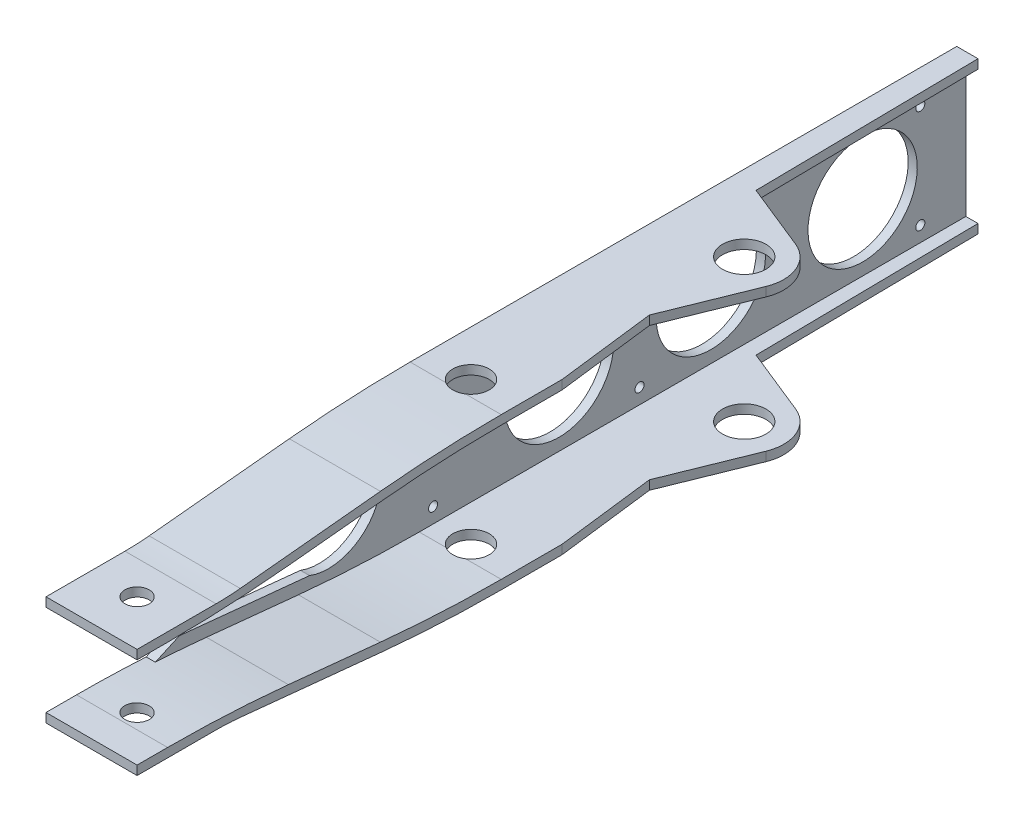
ISO-10303-21;
HEADER;
FILE_DESCRIPTION(('STEP AP214'),'2;1');
FILE_NAME('part.step','',(''),(''),'','','');
FILE_SCHEMA(('AUTOMOTIVE_DESIGN { 1 0 10303 214 1 1 1 1 }'));
ENDSEC;
DATA;
#1=APPLICATION_CONTEXT('core data for automotive mechanical design processes');
#2=APPLICATION_PROTOCOL_DEFINITION('international standard','automotive_design',2000,#1);
#3=PRODUCT_CONTEXT('',#1,'mechanical');
#4=PRODUCT('Part','Part','',(#3));
#5=PRODUCT_RELATED_PRODUCT_CATEGORY('part','',(#4));
#6=PRODUCT_DEFINITION_FORMATION('','',#4);
#7=PRODUCT_DEFINITION_CONTEXT('part definition',#1,'design');
#8=PRODUCT_DEFINITION('design','',#6,#7);
#9=PRODUCT_DEFINITION_SHAPE('','',#8);
#10=(LENGTH_UNIT() NAMED_UNIT(*) SI_UNIT(.MILLI.,.METRE.));
#11=(NAMED_UNIT(*) PLANE_ANGLE_UNIT() SI_UNIT($,.RADIAN.));
#12=(NAMED_UNIT(*) SI_UNIT($,.STERADIAN.) SOLID_ANGLE_UNIT());
#13=UNCERTAINTY_MEASURE_WITH_UNIT(LENGTH_MEASURE(1.E-05),#10,'distance_accuracy_value','');
#14=(GEOMETRIC_REPRESENTATION_CONTEXT(3) GLOBAL_UNCERTAINTY_ASSIGNED_CONTEXT((#13)) GLOBAL_UNIT_ASSIGNED_CONTEXT((#10,
#11,#12)) REPRESENTATION_CONTEXT('',''));
#15=CARTESIAN_POINT('',(0.,0.,0.));
#16=DIRECTION('',(0.,0.,1.));
#17=DIRECTION('',(1.,0.,0.));
#18=AXIS2_PLACEMENT_3D('',#15,#16,#17);
#19=CARTESIAN_POINT('',(-12.,22.,-100.));
#20=DIRECTION('',(1.,0.,0.));
#21=DIRECTION('',(0.,1.,0.));
#22=AXIS2_PLACEMENT_3D('',#19,#20,#21);
#23=PLANE('',#22);
#24=CARTESIAN_POINT('',(-12.,17.,-285.));
#25=DIRECTION('',(1.,0.,0.));
#26=DIRECTION('',(0.,1.,0.));
#27=AXIS2_PLACEMENT_3D('',#24,#25,#26);
#28=CIRCLE('',#27,1.5);
#29=CARTESIAN_POINT('',(-12.,18.5,-285.));
#30=VERTEX_POINT('',#29);
#31=EDGE_CURVE('E1372',#30,#30,#28,.T.);
#32=ORIENTED_EDGE('',*,*,#31,.F.);
#33=EDGE_LOOP('',(#32));
#34=FACE_BOUND('',#33,.T.);
#35=CARTESIAN_POINT('',(-12.,17.,-124.5));
#36=DIRECTION('',(1.,0.,0.));
#37=DIRECTION('',(0.,1.,0.));
#38=AXIS2_PLACEMENT_3D('',#35,#36,#37);
#39=CIRCLE('',#38,1.5);
#40=CARTESIAN_POINT('',(-12.,18.5,-124.5));
#41=VERTEX_POINT('',#40);
#42=EDGE_CURVE('E1380',#41,#41,#39,.T.);
#43=ORIENTED_EDGE('',*,*,#42,.F.);
#44=EDGE_LOOP('',(#43));
#45=FACE_BOUND('',#44,.T.);
#46=CARTESIAN_POINT('',(-12.,17.,-192.5));
#47=DIRECTION('',(1.,0.,0.));
#48=DIRECTION('',(0.,1.,0.));
#49=AXIS2_PLACEMENT_3D('',#46,#47,#48);
#50=CIRCLE('',#49,1.5);
#51=CARTESIAN_POINT('',(-12.,18.5,-192.5));
#52=VERTEX_POINT('',#51);
#53=EDGE_CURVE('E1386',#52,#52,#50,.T.);
#54=ORIENTED_EDGE('',*,*,#53,.F.);
#55=EDGE_LOOP('',(#54));
#56=FACE_BOUND('',#55,.T.);
#57=CARTESIAN_POINT('',(-12.,-17.,-124.5));
#58=DIRECTION('',(1.,0.,0.));
#59=DIRECTION('',(0.,1.,0.));
#60=AXIS2_PLACEMENT_3D('',#57,#58,#59);
#61=CIRCLE('',#60,1.5);
#62=CARTESIAN_POINT('',(-12.,-15.5,-124.5));
#63=VERTEX_POINT('',#62);
#64=EDGE_CURVE('E1392',#63,#63,#61,.T.);
#65=ORIENTED_EDGE('',*,*,#64,.F.);
#66=EDGE_LOOP('',(#65));
#67=FACE_BOUND('',#66,.T.);
#68=CARTESIAN_POINT('',(-12.,-17.,-192.5));
#69=DIRECTION('',(1.,0.,0.));
#70=DIRECTION('',(0.,1.,0.));
#71=AXIS2_PLACEMENT_3D('',#68,#69,#70);
#72=CIRCLE('',#71,1.5);
#73=CARTESIAN_POINT('',(-12.,-15.5,-192.5));
#74=VERTEX_POINT('',#73);
#75=EDGE_CURVE('E1398',#74,#74,#72,.T.);
#76=ORIENTED_EDGE('',*,*,#75,.F.);
#77=EDGE_LOOP('',(#76));
#78=FACE_BOUND('',#77,.T.);
#79=CARTESIAN_POINT('',(-12.,-17.,-285.));
#80=DIRECTION('',(1.,0.,0.));
#81=DIRECTION('',(0.,1.,0.));
#82=AXIS2_PLACEMENT_3D('',#79,#80,#81);
#83=CIRCLE('',#82,1.5);
#84=CARTESIAN_POINT('',(-12.,-15.5,-285.));
#85=VERTEX_POINT('',#84);
#86=EDGE_CURVE('E837',#85,#85,#83,.T.);
#87=ORIENTED_EDGE('',*,*,#86,.F.);
#88=EDGE_LOOP('',(#87));
#89=FACE_BOUND('',#88,.T.);
#90=CARTESIAN_POINT('',(-12.,0.,-166.));
#91=DIRECTION('',(1.,0.,0.));
#92=DIRECTION('',(0.,1.,0.));
#93=AXIS2_PLACEMENT_3D('',#90,#91,#92);
#94=CIRCLE('',#93,18.);
#95=CARTESIAN_POINT('',(-12.,18.,-166.));
#96=VERTEX_POINT('',#95);
#97=EDGE_CURVE('E369',#96,#96,#94,.T.);
#98=ORIENTED_EDGE('',*,*,#97,.F.);
#99=EDGE_LOOP('',(#98));
#100=FACE_BOUND('',#99,.T.);
#101=CARTESIAN_POINT('',(-12.,0.,-266.));
#102=DIRECTION('',(1.,0.,0.));
#103=DIRECTION('',(0.,1.,0.));
#104=AXIS2_PLACEMENT_3D('',#101,#102,#103);
#105=CIRCLE('',#104,18.);
#106=CARTESIAN_POINT('',(-12.,18.,-266.));
#107=VERTEX_POINT('',#106);
#108=EDGE_CURVE('E732',#107,#107,#105,.T.);
#109=ORIENTED_EDGE('',*,*,#108,.F.);
#110=EDGE_LOOP('',(#109));
#111=FACE_BOUND('',#110,.T.);
#112=CARTESIAN_POINT('',(-12.,0.,-216.));
#113=DIRECTION('',(1.,0.,0.));
#114=DIRECTION('',(0.,1.,0.));
#115=AXIS2_PLACEMENT_3D('',#112,#113,#114);
#116=CIRCLE('',#115,18.);
#117=CARTESIAN_POINT('',(-12.,18.,-216.));
#118=VERTEX_POINT('',#117);
#119=EDGE_CURVE('E729',#118,#118,#116,.T.);
#120=ORIENTED_EDGE('',*,*,#119,.F.);
#121=EDGE_LOOP('',(#120));
#122=FACE_BOUND('',#121,.T.);
#123=DIRECTION('',(0.,0.0995037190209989,0.995037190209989));
#124=VECTOR('',#123,1.);
#125=CARTESIAN_POINT('',(-12.,-17.5842076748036,-96.0415792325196));
#126=LINE('',#125,#124);
#127=CARTESIAN_POINT('',(-12.,-16.358313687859,-83.7826393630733));
#128=VERTEX_POINT('',#127);
#129=CARTESIAN_POINT('',(-12.,-12.0743408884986,-40.9429113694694));
#130=VERTEX_POINT('',#129);
#131=EDGE_CURVE('E724',#128,#130,#126,.T.);
#132=ORIENTED_EDGE('',*,*,#131,.T.);
#133=DIRECTION('',(0.,-0.411345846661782,0.911479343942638));
#134=VECTOR('',#133,1.);
#135=CARTESIAN_POINT('',(-12.,15.8336875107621,-102.782824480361));
#136=LINE('',#135,#134);
#137=CARTESIAN_POINT('',(-12.,-15.6589351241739,-33.0000000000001));
#138=VERTEX_POINT('',#137);
#139=EDGE_CURVE('E702',#130,#138,#136,.T.);
#140=ORIENTED_EDGE('',*,*,#139,.T.);
#141=CARTESIAN_POINT('',(-12.0000000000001,-415.,-10.049751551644));
#142=DIRECTION('',(1.,0.,0.));
#143=DIRECTION('',(0.,1.,0.));
#144=AXIS2_PLACEMENT_3D('',#141,#142,#143);
#145=CIRCLE('',#144,400.);
#146=CARTESIAN_POINT('',(-12.,-16.9851239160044,-49.8512391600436));
#147=VERTEX_POINT('',#146);
#148=EDGE_CURVE('E350',#138,#147,#145,.F.);
#149=ORIENTED_EDGE('',*,*,#148,.T.);
#150=DIRECTION('',(0.,0.0995037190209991,0.995037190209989));
#151=VECTOR('',#150,1.);
#152=CARTESIAN_POINT('',(-12.,-22.,-100.));
#153=LINE('',#152,#151);
#154=CARTESIAN_POINT('',(-12.,-20.0148760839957,-80.1487608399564));
#155=VERTEX_POINT('',#154);
#156=EDGE_CURVE('E562',#155,#147,#153,.T.);
#157=ORIENTED_EDGE('',*,*,#156,.F.);
#158=CARTESIAN_POINT('',(-12.,378.,-119.950248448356));
#159=DIRECTION('',(1.,0.,0.));
#160=DIRECTION('',(0.,1.,0.));
#161=AXIS2_PLACEMENT_3D('',#158,#159,#160);
#162=CIRCLE('',#161,400.);
#163=CARTESIAN_POINT('',(-12.,-22.,-119.950248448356));
#164=VERTEX_POINT('',#163);
#165=EDGE_CURVE('E580',#155,#164,#162,.T.);
#166=ORIENTED_EDGE('',*,*,#165,.T.);
#167=DIRECTION('',(0.,0.,-1.));
#168=VECTOR('',#167,1.);
#169=CARTESIAN_POINT('',(-12.,-22.,-37.1987261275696));
#170=LINE('',#169,#168);
#171=CARTESIAN_POINT('',(-12.,-22.,-300.));
#172=VERTEX_POINT('',#171);
#173=EDGE_CURVE('E749',#164,#172,#170,.T.);
#174=ORIENTED_EDGE('',*,*,#173,.T.);
#175=DIRECTION('',(0.,1.,0.));
#176=VECTOR('',#175,1.);
#177=CARTESIAN_POINT('',(-12.,22.,-300.));
#178=LINE('',#177,#176);
#179=CARTESIAN_POINT('',(-12.,22.,-300.));
#180=VERTEX_POINT('',#179);
#181=EDGE_CURVE('E746',#172,#180,#178,.T.);
#182=ORIENTED_EDGE('',*,*,#181,.T.);
#183=DIRECTION('',(0.,0.,-1.));
#184=VECTOR('',#183,1.);
#185=CARTESIAN_POINT('',(-12.,22.,-37.1987261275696));
#186=LINE('',#185,#184);
#187=CARTESIAN_POINT('',(-12.,22.,-119.950248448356));
#188=VERTEX_POINT('',#187);
#189=EDGE_CURVE('E745',#188,#180,#186,.T.);
#190=ORIENTED_EDGE('',*,*,#189,.F.);
#191=CARTESIAN_POINT('',(-12.0000000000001,-378.,-119.950248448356));
#192=DIRECTION('',(1.,0.,0.));
#193=DIRECTION('',(0.,1.,0.));
#194=AXIS2_PLACEMENT_3D('',#191,#192,#193);
#195=CIRCLE('',#194,400.);
#196=CARTESIAN_POINT('',(-12.,20.0148760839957,-80.1487608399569));
#197=VERTEX_POINT('',#196);
#198=EDGE_CURVE('E582',#188,#197,#195,.T.);
#199=ORIENTED_EDGE('',*,*,#198,.T.);
#200=DIRECTION('',(0.,-0.0995037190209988,0.995037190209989));
#201=VECTOR('',#200,1.);
#202=CARTESIAN_POINT('',(-12.,22.,-100.));
#203=LINE('',#202,#201);
#204=CARTESIAN_POINT('',(-12.,16.9851239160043,-49.8512391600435));
#205=VERTEX_POINT('',#204);
#206=EDGE_CURVE('E565',#197,#205,#203,.T.);
#207=ORIENTED_EDGE('',*,*,#206,.T.);
#208=CARTESIAN_POINT('',(-12.,415.,-10.049751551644));
#209=DIRECTION('',(1.,0.,0.));
#210=DIRECTION('',(0.,1.,0.));
#211=AXIS2_PLACEMENT_3D('',#208,#209,#210);
#212=CIRCLE('',#211,400.);
#213=CARTESIAN_POINT('',(-12.,15.6589351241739,-33.));
#214=VERTEX_POINT('',#213);
#215=EDGE_CURVE('E348',#205,#214,#212,.F.);
#216=ORIENTED_EDGE('',*,*,#215,.T.);
#217=DIRECTION('',(0.,-0.411345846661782,-0.911479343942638));
#218=VECTOR('',#217,1.);
#219=CARTESIAN_POINT('',(-12.,-8.38864966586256,-86.2857618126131));
#220=LINE('',#219,#218);
#221=CARTESIAN_POINT('',(-12.,12.0743408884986,-40.9429113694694));
#222=VERTEX_POINT('',#221);
#223=EDGE_CURVE('E718',#214,#222,#220,.T.);
#224=ORIENTED_EDGE('',*,*,#223,.T.);
#225=DIRECTION('',(0.,0.0995037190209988,-0.995037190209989));
#226=VECTOR('',#225,1.);
#227=CARTESIAN_POINT('',(-12.,18.01985123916,-100.398014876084));
#228=LINE('',#227,#226);
#229=CARTESIAN_POINT('',(-12.,16.358313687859,-83.7826393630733));
#230=VERTEX_POINT('',#229);
#231=EDGE_CURVE('E720',#222,#230,#228,.T.);
#232=ORIENTED_EDGE('',*,*,#231,.T.);
#233=CARTESIAN_POINT('',(-12.,0.,-90.));
#234=DIRECTION('',(1.,0.,0.));
#235=DIRECTION('',(0.,1.,0.));
#236=AXIS2_PLACEMENT_3D('',#233,#234,#235);
#237=CIRCLE('',#236,17.5);
#238=EDGE_CURVE('E722',#230,#128,#237,.F.);
#239=ORIENTED_EDGE('',*,*,#238,.T.);
#240=EDGE_LOOP('',(#132,#140,#149,#157,#166,#174,#182,#190,#199,#207,#216,#224,#232,#239));
#241=FACE_BOUND('',#240,.T.);
#242=ADVANCED_FACE('F37',(#34,#45,#56,#67,#78,#89,#100,#111,#122,#241),#23,.T.);
#243=CARTESIAN_POINT('',(-15.,-18.,-30.));
#244=DIRECTION('',(-1.,0.,0.));
#245=DIRECTION('',(0.,0.,1.));
#246=AXIS2_PLACEMENT_3D('',#243,#244,#245);
#247=PLANE('',#246);
#248=CARTESIAN_POINT('',(-15.,17.,-285.));
#249=DIRECTION('',(-1.,0.,0.));
#250=DIRECTION('',(0.,0.,1.));
#251=AXIS2_PLACEMENT_3D('',#248,#249,#250);
#252=CIRCLE('',#251,1.5);
#253=CARTESIAN_POINT('',(-15.,17.,-283.5));
#254=VERTEX_POINT('',#253);
#255=EDGE_CURVE('E1370',#254,#254,#252,.T.);
#256=ORIENTED_EDGE('',*,*,#255,.F.);
#257=EDGE_LOOP('',(#256));
#258=FACE_BOUND('',#257,.T.);
#259=CARTESIAN_POINT('',(-15.,17.,-124.5));
#260=DIRECTION('',(-1.,0.,0.));
#261=DIRECTION('',(0.,0.,1.));
#262=AXIS2_PLACEMENT_3D('',#259,#260,#261);
#263=CIRCLE('',#262,1.5);
#264=CARTESIAN_POINT('',(-15.,17.,-123.));
#265=VERTEX_POINT('',#264);
#266=EDGE_CURVE('E1377',#265,#265,#263,.T.);
#267=ORIENTED_EDGE('',*,*,#266,.F.);
#268=EDGE_LOOP('',(#267));
#269=FACE_BOUND('',#268,.T.);
#270=CARTESIAN_POINT('',(-15.,17.,-192.5));
#271=DIRECTION('',(-1.,0.,0.));
#272=DIRECTION('',(0.,0.,1.));
#273=AXIS2_PLACEMENT_3D('',#270,#271,#272);
#274=CIRCLE('',#273,1.5);
#275=CARTESIAN_POINT('',(-15.,17.,-191.));
#276=VERTEX_POINT('',#275);
#277=EDGE_CURVE('E1383',#276,#276,#274,.T.);
#278=ORIENTED_EDGE('',*,*,#277,.F.);
#279=EDGE_LOOP('',(#278));
#280=FACE_BOUND('',#279,.T.);
#281=CARTESIAN_POINT('',(-15.,-17.,-124.5));
#282=DIRECTION('',(-1.,0.,0.));
#283=DIRECTION('',(0.,0.,1.));
#284=AXIS2_PLACEMENT_3D('',#281,#282,#283);
#285=CIRCLE('',#284,1.5);
#286=CARTESIAN_POINT('',(-15.,-17.,-123.));
#287=VERTEX_POINT('',#286);
#288=EDGE_CURVE('E1389',#287,#287,#285,.T.);
#289=ORIENTED_EDGE('',*,*,#288,.F.);
#290=EDGE_LOOP('',(#289));
#291=FACE_BOUND('',#290,.T.);
#292=CARTESIAN_POINT('',(-15.,-17.,-192.5));
#293=DIRECTION('',(-1.,0.,0.));
#294=DIRECTION('',(0.,0.,1.));
#295=AXIS2_PLACEMENT_3D('',#292,#293,#294);
#296=CIRCLE('',#295,1.5);
#297=CARTESIAN_POINT('',(-15.,-17.,-191.));
#298=VERTEX_POINT('',#297);
#299=EDGE_CURVE('E1395',#298,#298,#296,.T.);
#300=ORIENTED_EDGE('',*,*,#299,.F.);
#301=EDGE_LOOP('',(#300));
#302=FACE_BOUND('',#301,.T.);
#303=CARTESIAN_POINT('',(-15.,-17.,-285.));
#304=DIRECTION('',(-1.,0.,0.));
#305=DIRECTION('',(0.,0.,1.));
#306=AXIS2_PLACEMENT_3D('',#303,#304,#305);
#307=CIRCLE('',#306,1.5);
#308=CARTESIAN_POINT('',(-15.,-17.,-283.5));
#309=VERTEX_POINT('',#308);
#310=EDGE_CURVE('E1400',#309,#309,#307,.T.);
#311=ORIENTED_EDGE('',*,*,#310,.F.);
#312=EDGE_LOOP('',(#311));
#313=FACE_BOUND('',#312,.T.);
#314=CARTESIAN_POINT('',(-15.,0.,-166.));
#315=DIRECTION('',(1.,0.,0.));
#316=DIRECTION('',(0.,1.,0.));
#317=AXIS2_PLACEMENT_3D('',#314,#315,#316);
#318=CIRCLE('',#317,18.);
#319=CARTESIAN_POINT('',(-15.,18.,-166.));
#320=VERTEX_POINT('',#319);
#321=EDGE_CURVE('E366',#320,#320,#318,.T.);
#322=ORIENTED_EDGE('',*,*,#321,.T.);
#323=EDGE_LOOP('',(#322));
#324=FACE_BOUND('',#323,.T.);
#325=CARTESIAN_POINT('',(-15.,0.,-266.));
#326=DIRECTION('',(1.,0.,0.));
#327=DIRECTION('',(0.,1.,0.));
#328=AXIS2_PLACEMENT_3D('',#325,#326,#327);
#329=CIRCLE('',#328,18.);
#330=CARTESIAN_POINT('',(-15.,18.,-266.));
#331=VERTEX_POINT('',#330);
#332=EDGE_CURVE('E733',#331,#331,#329,.T.);
#333=ORIENTED_EDGE('',*,*,#332,.T.);
#334=EDGE_LOOP('',(#333));
#335=FACE_BOUND('',#334,.T.);
#336=CARTESIAN_POINT('',(-15.,0.,-216.));
#337=DIRECTION('',(1.,0.,0.));
#338=DIRECTION('',(0.,1.,0.));
#339=AXIS2_PLACEMENT_3D('',#336,#337,#338);
#340=CIRCLE('',#339,18.);
#341=CARTESIAN_POINT('',(-15.,18.,-216.));
#342=VERTEX_POINT('',#341);
#343=EDGE_CURVE('E726',#342,#342,#340,.T.);
#344=ORIENTED_EDGE('',*,*,#343,.T.);
#345=EDGE_LOOP('',(#344));
#346=FACE_BOUND('',#345,.T.);
#347=DIRECTION('',(0.,-1.,0.));
#348=VECTOR('',#347,1.);
#349=CARTESIAN_POINT('',(-15.,-18.,0.));
#350=LINE('',#349,#348);
#351=CARTESIAN_POINT('',(-15.,-15.,0.));
#352=VERTEX_POINT('',#351);
#353=CARTESIAN_POINT('',(-15.,-18.,0.));
#354=VERTEX_POINT('',#353);
#355=EDGE_CURVE('E546',#352,#354,#350,.T.);
#356=ORIENTED_EDGE('',*,*,#355,.F.);
#357=DIRECTION('',(0.,0.,-1.));
#358=VECTOR('',#357,1.);
#359=CARTESIAN_POINT('',(-15.,-15.,-30.));
#360=LINE('',#359,#358);
#361=CARTESIAN_POINT('',(-15.,-15.,-10.049751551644));
#362=VERTEX_POINT('',#361);
#363=EDGE_CURVE('E707',#352,#362,#360,.T.);
#364=ORIENTED_EDGE('',*,*,#363,.T.);
#365=CARTESIAN_POINT('',(-15.,-415.,-10.049751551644));
#366=DIRECTION('',(-1.,0.,0.));
#367=DIRECTION('',(0.,0.,1.));
#368=AXIS2_PLACEMENT_3D('',#365,#366,#367);
#369=CIRCLE('',#368,400.);
#370=CARTESIAN_POINT('',(-15.,-15.6589351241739,-33.0000000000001));
#371=VERTEX_POINT('',#370);
#372=EDGE_CURVE('E705',#362,#371,#369,.T.);
#373=ORIENTED_EDGE('',*,*,#372,.T.);
#374=DIRECTION('',(0.,0.411345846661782,-0.911479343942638));
#375=VECTOR('',#374,1.);
#376=CARTESIAN_POINT('',(-15.,-17.1798556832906,-29.6298731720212));
#377=LINE('',#376,#375);
#378=CARTESIAN_POINT('',(-15.,-12.0743408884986,-40.9429113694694));
#379=VERTEX_POINT('',#378);
#380=EDGE_CURVE('E700',#371,#379,#377,.T.);
#381=ORIENTED_EDGE('',*,*,#380,.T.);
#382=DIRECTION('',(0.,-0.0995037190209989,-0.995037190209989));
#383=VECTOR('',#382,1.);
#384=CARTESIAN_POINT('',(-15.,-11.0495542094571,-30.6950445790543));
#385=LINE('',#384,#383);
#386=CARTESIAN_POINT('',(-15.,-16.358313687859,-83.7826393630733));
#387=VERTEX_POINT('',#386);
#388=EDGE_CURVE('E376',#379,#387,#385,.T.);
#389=ORIENTED_EDGE('',*,*,#388,.T.);
#390=CARTESIAN_POINT('',(-15.,0.,-90.));
#391=DIRECTION('',(-1.,0.,0.));
#392=DIRECTION('',(0.,0.,1.));
#393=AXIS2_PLACEMENT_3D('',#390,#391,#392);
#394=CIRCLE('',#393,17.5);
#395=CARTESIAN_POINT('',(-15.,16.358313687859,-83.7826393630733));
#396=VERTEX_POINT('',#395);
#397=EDGE_CURVE('E374',#387,#396,#394,.F.);
#398=ORIENTED_EDGE('',*,*,#397,.T.);
#399=DIRECTION('',(0.,-0.0995037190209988,0.995037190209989));
#400=VECTOR('',#399,1.);
#401=CARTESIAN_POINT('',(-15.,10.6931185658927,-27.1306881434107));
#402=LINE('',#401,#400);
#403=CARTESIAN_POINT('',(-15.,12.0743408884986,-40.9429113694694));
#404=VERTEX_POINT('',#403);
#405=EDGE_CURVE('E372',#396,#404,#402,.T.);
#406=ORIENTED_EDGE('',*,*,#405,.T.);
#407=DIRECTION('',(0.,0.411345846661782,0.911479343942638));
#408=VECTOR('',#407,1.);
#409=CARTESIAN_POINT('',(-15.,11.0884610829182,-43.1274699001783));
#410=LINE('',#409,#408);
#411=CARTESIAN_POINT('',(-15.,15.6589351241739,-33.));
#412=VERTEX_POINT('',#411);
#413=EDGE_CURVE('E716',#404,#412,#410,.T.);
#414=ORIENTED_EDGE('',*,*,#413,.T.);
#415=CARTESIAN_POINT('',(-15.,415.,-10.049751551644));
#416=DIRECTION('',(-1.,0.,0.));
#417=DIRECTION('',(0.,0.,1.));
#418=AXIS2_PLACEMENT_3D('',#415,#416,#417);
#419=CIRCLE('',#418,400.);
#420=CARTESIAN_POINT('',(-15.,15.,-10.0497515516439));
#421=VERTEX_POINT('',#420);
#422=EDGE_CURVE('E713',#412,#421,#419,.T.);
#423=ORIENTED_EDGE('',*,*,#422,.T.);
#424=DIRECTION('',(0.,0.,1.));
#425=VECTOR('',#424,1.);
#426=CARTESIAN_POINT('',(-15.,15.,-30.));
#427=LINE('',#426,#425);
#428=CARTESIAN_POINT('',(-15.,15.,0.));
#429=VERTEX_POINT('',#428);
#430=EDGE_CURVE('E710',#421,#429,#427,.T.);
#431=ORIENTED_EDGE('',*,*,#430,.T.);
#432=CARTESIAN_POINT('',(-15.,18.,0.));
#433=VERTEX_POINT('',#432);
#434=EDGE_CURVE('E549',#433,#429,#350,.T.);
#435=ORIENTED_EDGE('',*,*,#434,.F.);
#436=DIRECTION('',(0.,0.,1.));
#437=VECTOR('',#436,1.);
#438=CARTESIAN_POINT('',(-15.,18.,-82.3450093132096));
#439=LINE('',#438,#437);
#440=CARTESIAN_POINT('',(-15.,18.,-26.0099503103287));
#441=VERTEX_POINT('',#440);
#442=EDGE_CURVE('E559',#441,#433,#439,.T.);
#443=ORIENTED_EDGE('',*,*,#442,.F.);
#444=CARTESIAN_POINT('',(-15.,98.,-26.0099503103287));
#445=DIRECTION('',(-1.,0.,0.));
#446=DIRECTION('',(0.,0.,1.));
#447=AXIS2_PLACEMENT_3D('',#444,#445,#446);
#448=CIRCLE('',#447,80.);
#449=CARTESIAN_POINT('',(-15.,18.3970247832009,-33.9702478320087));
#450=VERTEX_POINT('',#449);
#451=EDGE_CURVE('E362',#441,#450,#448,.F.);
#452=ORIENTED_EDGE('',*,*,#451,.T.);
#453=DIRECTION('',(0.,-0.0995037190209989,0.995037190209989));
#454=VECTOR('',#453,1.);
#455=CARTESIAN_POINT('',(-15.,25.,-100.));
#456=LINE('',#455,#454);
#457=CARTESIAN_POINT('',(-15.,23.0148760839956,-80.1487608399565));
#458=VERTEX_POINT('',#457);
#459=EDGE_CURVE('E569',#458,#450,#456,.T.);
#460=ORIENTED_EDGE('',*,*,#459,.F.);
#461=CARTESIAN_POINT('',(-15.,-375.,-119.950248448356));
#462=DIRECTION('',(-1.,0.,0.));
#463=DIRECTION('',(0.,0.,1.));
#464=AXIS2_PLACEMENT_3D('',#461,#462,#463);
#465=CIRCLE('',#464,400.);
#466=CARTESIAN_POINT('',(-15.,25.,-119.950248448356));
#467=VERTEX_POINT('',#466);
#468=EDGE_CURVE('E340',#458,#467,#465,.T.);
#469=ORIENTED_EDGE('',*,*,#468,.T.);
#470=DIRECTION('',(0.,0.,-1.));
#471=VECTOR('',#470,1.);
#472=CARTESIAN_POINT('',(-15.,25.,-37.1987261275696));
#473=LINE('',#472,#471);
#474=CARTESIAN_POINT('',(-15.,25.,-300.));
#475=VERTEX_POINT('',#474);
#476=EDGE_CURVE('E736',#467,#475,#473,.T.);
#477=ORIENTED_EDGE('',*,*,#476,.T.);
#478=DIRECTION('',(0.,-1.,0.));
#479=VECTOR('',#478,1.);
#480=CARTESIAN_POINT('',(-15.,-25.,-300.));
#481=LINE('',#480,#479);
#482=CARTESIAN_POINT('',(-15.,-25.,-300.));
#483=VERTEX_POINT('',#482);
#484=EDGE_CURVE('E755',#475,#483,#481,.T.);
#485=ORIENTED_EDGE('',*,*,#484,.T.);
#486=DIRECTION('',(0.,0.,-1.));
#487=VECTOR('',#486,1.);
#488=CARTESIAN_POINT('',(-15.,-25.,-37.1987261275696));
#489=LINE('',#488,#487);
#490=CARTESIAN_POINT('',(-15.,-25.,-119.950248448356));
#491=VERTEX_POINT('',#490);
#492=EDGE_CURVE('E611',#491,#483,#489,.T.);
#493=ORIENTED_EDGE('',*,*,#492,.F.);
#494=CARTESIAN_POINT('',(-15.,375.,-119.950248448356));
#495=DIRECTION('',(-1.,0.,0.));
#496=DIRECTION('',(0.,0.,1.));
#497=AXIS2_PLACEMENT_3D('',#494,#495,#496);
#498=CIRCLE('',#497,400.);
#499=CARTESIAN_POINT('',(-15.,-23.0148760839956,-80.1487608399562));
#500=VERTEX_POINT('',#499);
#501=EDGE_CURVE('E338',#491,#500,#498,.T.);
#502=ORIENTED_EDGE('',*,*,#501,.T.);
#503=DIRECTION('',(0.,0.0995037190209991,0.995037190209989));
#504=VECTOR('',#503,1.);
#505=CARTESIAN_POINT('',(-15.,-25.,-100.));
#506=LINE('',#505,#504);
#507=CARTESIAN_POINT('',(-15.,-18.3970247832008,-33.9702478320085));
#508=VERTEX_POINT('',#507);
#509=EDGE_CURVE('E572',#500,#508,#506,.T.);
#510=ORIENTED_EDGE('',*,*,#509,.T.);
#511=CARTESIAN_POINT('',(-15.,-98.,-26.0099503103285));
#512=DIRECTION('',(-1.,0.,0.));
#513=DIRECTION('',(0.,0.,1.));
#514=AXIS2_PLACEMENT_3D('',#511,#512,#513);
#515=CIRCLE('',#514,80.);
#516=CARTESIAN_POINT('',(-15.,-18.,-26.0099503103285));
#517=VERTEX_POINT('',#516);
#518=EDGE_CURVE('E364',#508,#517,#515,.F.);
#519=ORIENTED_EDGE('',*,*,#518,.T.);
#520=DIRECTION('',(0.,0.,1.));
#521=VECTOR('',#520,1.);
#522=CARTESIAN_POINT('',(-15.,-18.,-82.3450093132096));
#523=LINE('',#522,#521);
#524=EDGE_CURVE('E560',#517,#354,#523,.T.);
#525=ORIENTED_EDGE('',*,*,#524,.T.);
#526=EDGE_LOOP('',(#356,#364,#373,#381,#389,#398,#406,#414,#423,#431,#435,#443,#452,#460,#469,
#477,#485,#493,#502,#510,#519,#525));
#527=FACE_BOUND('',#526,.T.);
#528=ADVANCED_FACE('F468',(#258,#269,#280,#291,#302,#313,#324,#335,#346,#527),#247,.T.);
#529=CARTESIAN_POINT('',(23.,18.,0.));
#530=DIRECTION('',(0.,0.,1.));
#531=DIRECTION('',(1.,0.,0.));
#532=AXIS2_PLACEMENT_3D('',#529,#530,#531);
#533=PLANE('',#532);
#534=DIRECTION('',(0.,1.,0.));
#535=VECTOR('',#534,1.);
#536=CARTESIAN_POINT('',(15.,-25.,0.));
#537=LINE('',#536,#535);
#538=CARTESIAN_POINT('',(15.,-18.,0.));
#539=VERTEX_POINT('',#538);
#540=CARTESIAN_POINT('',(15.,-15.,0.));
#541=VERTEX_POINT('',#540);
#542=EDGE_CURVE('E541',#539,#541,#537,.T.);
#543=ORIENTED_EDGE('',*,*,#542,.T.);
#544=DIRECTION('',(-1.,0.,0.));
#545=VECTOR('',#544,1.);
#546=CARTESIAN_POINT('',(-12.,-15.,0.));
#547=LINE('',#546,#545);
#548=EDGE_CURVE('E548',#541,#352,#547,.T.);
#549=ORIENTED_EDGE('',*,*,#548,.T.);
#550=ORIENTED_EDGE('',*,*,#355,.T.);
#551=DIRECTION('',(1.,0.,0.));
#552=VECTOR('',#551,1.);
#553=CARTESIAN_POINT('',(23.,-18.,0.));
#554=LINE('',#553,#552);
#555=EDGE_CURVE('E537',#354,#539,#554,.T.);
#556=ORIENTED_EDGE('',*,*,#555,.T.);
#557=EDGE_LOOP('',(#543,#549,#550,#556));
#558=FACE_BOUND('',#557,.T.);
#559=ADVANCED_FACE('F474',(#558),#533,.T.);
#560=CARTESIAN_POINT('',(15.,15.,0.));
#561=VERTEX_POINT('',#560);
#562=CARTESIAN_POINT('',(15.,18.,0.));
#563=VERTEX_POINT('',#562);
#564=EDGE_CURVE('E764',#561,#563,#537,.T.);
#565=ORIENTED_EDGE('',*,*,#564,.T.);
#566=DIRECTION('',(-1.,0.,0.));
#567=VECTOR('',#566,1.);
#568=CARTESIAN_POINT('',(-15.,18.,0.));
#569=LINE('',#568,#567);
#570=EDGE_CURVE('E741',#563,#433,#569,.T.);
#571=ORIENTED_EDGE('',*,*,#570,.T.);
#572=ORIENTED_EDGE('',*,*,#434,.T.);
#573=DIRECTION('',(1.,0.,0.));
#574=VECTOR('',#573,1.);
#575=CARTESIAN_POINT('',(23.,15.,0.));
#576=LINE('',#575,#574);
#577=EDGE_CURVE('E551',#429,#561,#576,.T.);
#578=ORIENTED_EDGE('',*,*,#577,.T.);
#579=EDGE_LOOP('',(#565,#571,#572,#578));
#580=FACE_BOUND('',#579,.T.);
#581=ADVANCED_FACE('F494',(#580),#533,.T.);
#582=CARTESIAN_POINT('',(23.,22.,-100.));
#583=DIRECTION('',(0.,-0.995037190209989,-0.0995037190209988));
#584=DIRECTION('',(0.,0.0995037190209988,-0.995037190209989));
#585=AXIS2_PLACEMENT_3D('',#582,#583,#584);
#586=PLANE('',#585);
#587=DIRECTION('',(0.,0.0995037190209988,-0.995037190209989));
#588=VECTOR('',#587,1.);
#589=CARTESIAN_POINT('',(15.,22.,-100.));
#590=LINE('',#589,#588);
#591=CARTESIAN_POINT('',(15.,16.9851239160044,-49.8512391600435));
#592=VERTEX_POINT('',#591);
#593=CARTESIAN_POINT('',(15.,20.0148760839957,-80.1487608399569));
#594=VERTEX_POINT('',#593);
#595=EDGE_CURVE('E645',#592,#594,#590,.T.);
#596=ORIENTED_EDGE('',*,*,#595,.F.);
#597=DIRECTION('',(-1.,0.,0.));
#598=VECTOR('',#597,1.);
#599=CARTESIAN_POINT('',(23.,16.9851239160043,-49.8512391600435));
#600=LINE('',#599,#598);
#601=EDGE_CURVE('E584',#592,#205,#600,.T.);
#602=ORIENTED_EDGE('',*,*,#601,.T.);
#603=ORIENTED_EDGE('',*,*,#206,.F.);
#604=DIRECTION('',(-1.,0.,0.));
#605=VECTOR('',#604,1.);
#606=CARTESIAN_POINT('',(23.,20.0148760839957,-80.1487608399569));
#607=LINE('',#606,#605);
#608=EDGE_CURVE('E586',#197,#594,#607,.F.);
#609=ORIENTED_EDGE('',*,*,#608,.T.);
#610=EDGE_LOOP('',(#596,#602,#603,#609));
#611=FACE_BOUND('',#610,.T.);
#612=ADVANCED_FACE('F481',(#611),#586,.T.);
#613=CARTESIAN_POINT('',(-15.,18.,-30.));
#614=DIRECTION('',(0.,0.995037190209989,0.099503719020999));
#615=DIRECTION('',(0.,-0.099503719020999,0.995037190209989));
#616=AXIS2_PLACEMENT_3D('',#613,#614,#615);
#617=PLANE('',#616);
#618=DIRECTION('',(0.,-0.099503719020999,0.995037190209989));
#619=VECTOR('',#618,1.);
#620=CARTESIAN_POINT('',(15.,18.,-30.));
#621=LINE('',#620,#619);
#622=CARTESIAN_POINT('',(15.,23.0148760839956,-80.1487608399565));
#623=VERTEX_POINT('',#622);
#624=CARTESIAN_POINT('',(15.,18.3970247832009,-33.9702478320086));
#625=VERTEX_POINT('',#624);
#626=EDGE_CURVE('E625',#623,#625,#621,.T.);
#627=ORIENTED_EDGE('',*,*,#626,.F.);
#628=DIRECTION('',(1.,0.,0.));
#629=VECTOR('',#628,1.);
#630=CARTESIAN_POINT('',(-15.,23.0148760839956,-80.1487608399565));
#631=LINE('',#630,#629);
#632=EDGE_CURVE('E607',#623,#458,#631,.F.);
#633=ORIENTED_EDGE('',*,*,#632,.T.);
#634=ORIENTED_EDGE('',*,*,#459,.T.);
#635=DIRECTION('',(1.,0.,0.));
#636=VECTOR('',#635,1.);
#637=CARTESIAN_POINT('',(23.,18.3970247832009,-33.9702478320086));
#638=LINE('',#637,#636);
#639=EDGE_CURVE('E352',#450,#625,#638,.T.);
#640=ORIENTED_EDGE('',*,*,#639,.T.);
#641=EDGE_LOOP('',(#627,#633,#634,#640));
#642=FACE_BOUND('',#641,.T.);
#643=ADVANCED_FACE('F483',(#642),#617,.T.);
#644=CARTESIAN_POINT('',(23.,-18.,-30.));
#645=DIRECTION('',(0.,-0.995037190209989,0.0995037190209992));
#646=DIRECTION('',(0.,-0.0995037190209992,-0.995037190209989));
#647=AXIS2_PLACEMENT_3D('',#644,#645,#646);
#648=PLANE('',#647);
#649=DIRECTION('',(0.,-0.0995037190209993,-0.995037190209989));
#650=VECTOR('',#649,1.);
#651=CARTESIAN_POINT('',(15.,-18.,-30.));
#652=LINE('',#651,#650);
#653=CARTESIAN_POINT('',(15.,-18.3970247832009,-33.9702478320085));
#654=VERTEX_POINT('',#653);
#655=CARTESIAN_POINT('',(15.,-23.0148760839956,-80.1487608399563));
#656=VERTEX_POINT('',#655);
#657=EDGE_CURVE('E540',#654,#656,#652,.T.);
#658=ORIENTED_EDGE('',*,*,#657,.F.);
#659=DIRECTION('',(-1.,0.,0.));
#660=VECTOR('',#659,1.);
#661=CARTESIAN_POINT('',(-15.,-18.3970247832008,-33.9702478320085));
#662=LINE('',#661,#660);
#663=EDGE_CURVE('E357',#654,#508,#662,.T.);
#664=ORIENTED_EDGE('',*,*,#663,.T.);
#665=ORIENTED_EDGE('',*,*,#509,.F.);
#666=DIRECTION('',(-1.,0.,0.));
#667=VECTOR('',#666,1.);
#668=CARTESIAN_POINT('',(23.0000000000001,-23.0148760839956,-80.1487608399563));
#669=LINE('',#668,#667);
#670=EDGE_CURVE('E342',#500,#656,#669,.F.);
#671=ORIENTED_EDGE('',*,*,#670,.T.);
#672=EDGE_LOOP('',(#658,#664,#665,#671));
#673=FACE_BOUND('',#672,.T.);
#674=ADVANCED_FACE('F485',(#673),#648,.T.);
#675=CARTESIAN_POINT('',(-12.,-22.,-100.));
#676=DIRECTION('',(0.,0.995037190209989,-0.0995037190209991));
#677=DIRECTION('',(0.,0.0995037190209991,0.995037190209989));
#678=AXIS2_PLACEMENT_3D('',#675,#676,#677);
#679=PLANE('',#678);
#680=DIRECTION('',(0.,0.0995037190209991,0.995037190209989));
#681=VECTOR('',#680,1.);
#682=CARTESIAN_POINT('',(15.,-22.,-100.));
#683=LINE('',#682,#681);
#684=CARTESIAN_POINT('',(15.,-20.0148760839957,-80.1487608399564));
#685=VERTEX_POINT('',#684);
#686=CARTESIAN_POINT('',(15.,-16.9851239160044,-49.8512391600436));
#687=VERTEX_POINT('',#686);
#688=EDGE_CURVE('E633',#685,#687,#683,.T.);
#689=ORIENTED_EDGE('',*,*,#688,.F.);
#690=DIRECTION('',(1.,0.,0.));
#691=VECTOR('',#690,1.);
#692=CARTESIAN_POINT('',(-12.,-20.0148760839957,-80.1487608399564));
#693=LINE('',#692,#691);
#694=EDGE_CURVE('E599',#685,#155,#693,.F.);
#695=ORIENTED_EDGE('',*,*,#694,.T.);
#696=ORIENTED_EDGE('',*,*,#156,.T.);
#697=DIRECTION('',(1.,0.,0.));
#698=VECTOR('',#697,1.);
#699=CARTESIAN_POINT('',(-12.0000000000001,-16.9851239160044,-49.8512391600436));
#700=LINE('',#699,#698);
#701=EDGE_CURVE('E596',#147,#687,#700,.T.);
#702=ORIENTED_EDGE('',*,*,#701,.T.);
#703=EDGE_LOOP('',(#689,#695,#696,#702));
#704=FACE_BOUND('',#703,.T.);
#705=ADVANCED_FACE('F489',(#704),#679,.T.);
#706=CARTESIAN_POINT('',(-15.,18.,-82.3450093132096));
#707=DIRECTION('',(0.,1.,0.));
#708=DIRECTION('',(0.,0.,1.));
#709=AXIS2_PLACEMENT_3D('',#706,#707,#708);
#710=PLANE('',#709);
#711=CARTESIAN_POINT('',(0.,18.,-15.));
#712=DIRECTION('',(0.,1.,0.));
#713=DIRECTION('',(0.,0.,1.));
#714=AXIS2_PLACEMENT_3D('',#711,#712,#713);
#715=CIRCLE('',#714,4.);
#716=CARTESIAN_POINT('',(0.,18.,-11.));
#717=VERTEX_POINT('',#716);
#718=EDGE_CURVE('E1368',#717,#717,#715,.T.);
#719=ORIENTED_EDGE('',*,*,#718,.F.);
#720=EDGE_LOOP('',(#719));
#721=FACE_BOUND('',#720,.T.);
#722=DIRECTION('',(0.,0.,1.));
#723=VECTOR('',#722,1.);
#724=CARTESIAN_POINT('',(15.,18.,-82.3450093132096));
#725=LINE('',#724,#723);
#726=CARTESIAN_POINT('',(15.,18.,-26.0099503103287));
#727=VERTEX_POINT('',#726);
#728=EDGE_CURVE('E620',#727,#563,#725,.T.);
#729=ORIENTED_EDGE('',*,*,#728,.F.);
#730=DIRECTION('',(1.,0.,0.));
#731=VECTOR('',#730,1.);
#732=CARTESIAN_POINT('',(-15.,18.,-26.0099503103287));
#733=LINE('',#732,#731);
#734=EDGE_CURVE('E355',#727,#441,#733,.F.);
#735=ORIENTED_EDGE('',*,*,#734,.T.);
#736=ORIENTED_EDGE('',*,*,#442,.T.);
#737=ORIENTED_EDGE('',*,*,#570,.F.);
#738=EDGE_LOOP('',(#729,#735,#736,#737));
#739=FACE_BOUND('',#738,.T.);
#740=ADVANCED_FACE('F492',(#721,#739),#710,.T.);
#741=CARTESIAN_POINT('',(23.,15.,-82.3450093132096));
#742=DIRECTION('',(0.,-1.,0.));
#743=DIRECTION('',(1.,0.,0.));
#744=AXIS2_PLACEMENT_3D('',#741,#742,#743);
#745=PLANE('',#744);
#746=DIRECTION('',(0.,0.,-1.));
#747=VECTOR('',#746,1.);
#748=CARTESIAN_POINT('',(15.,15.,-82.3450093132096));
#749=LINE('',#748,#747);
#750=CARTESIAN_POINT('',(15.,15.,-10.049751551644));
#751=VERTEX_POINT('',#750);
#752=EDGE_CURVE('E643',#561,#751,#749,.T.);
#753=ORIENTED_EDGE('',*,*,#752,.F.);
#754=ORIENTED_EDGE('',*,*,#577,.F.);
#755=ORIENTED_EDGE('',*,*,#430,.F.);
#756=DIRECTION('',(-1.,0.,0.));
#757=VECTOR('',#756,1.);
#758=CARTESIAN_POINT('',(23.,15.,-10.049751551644));
#759=LINE('',#758,#757);
#760=EDGE_CURVE('E589',#421,#751,#759,.F.);
#761=ORIENTED_EDGE('',*,*,#760,.T.);
#762=EDGE_LOOP('',(#753,#754,#755,#761));
#763=FACE_BOUND('',#762,.T.);
#764=ADVANCED_FACE('F498',(#763),#745,.T.);
#765=CARTESIAN_POINT('',(-12.,-15.,-82.3450093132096));
#766=DIRECTION('',(0.,1.,0.));
#767=DIRECTION('',(0.,0.,1.));
#768=AXIS2_PLACEMENT_3D('',#765,#766,#767);
#769=PLANE('',#768);
#770=DIRECTION('',(0.,0.,1.));
#771=VECTOR('',#770,1.);
#772=CARTESIAN_POINT('',(15.,-15.,-82.3450093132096));
#773=LINE('',#772,#771);
#774=CARTESIAN_POINT('',(15.,-15.,-10.049751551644));
#775=VERTEX_POINT('',#774);
#776=EDGE_CURVE('E631',#775,#541,#773,.T.);
#777=ORIENTED_EDGE('',*,*,#776,.F.);
#778=DIRECTION('',(1.,0.,0.));
#779=VECTOR('',#778,1.);
#780=CARTESIAN_POINT('',(-12.0000000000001,-15.,-10.049751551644));
#781=LINE('',#780,#779);
#782=EDGE_CURVE('E601',#775,#362,#781,.F.);
#783=ORIENTED_EDGE('',*,*,#782,.T.);
#784=ORIENTED_EDGE('',*,*,#363,.F.);
#785=ORIENTED_EDGE('',*,*,#548,.F.);
#786=EDGE_LOOP('',(#777,#783,#784,#785));
#787=FACE_BOUND('',#786,.T.);
#788=ADVANCED_FACE('F516',(#787),#769,.T.);
#789=CARTESIAN_POINT('',(23.,-18.,-82.3450093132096));
#790=DIRECTION('',(0.,-1.,0.));
#791=DIRECTION('',(1.,0.,0.));
#792=AXIS2_PLACEMENT_3D('',#789,#790,#791);
#793=PLANE('',#792);
#794=CARTESIAN_POINT('',(0.,-18.,-15.));
#795=DIRECTION('',(0.,-1.,0.));
#796=DIRECTION('',(1.,0.,0.));
#797=AXIS2_PLACEMENT_3D('',#794,#795,#796);
#798=CIRCLE('',#797,4.);
#799=CARTESIAN_POINT('',(4.,-18.,-15.));
#800=VERTEX_POINT('',#799);
#801=EDGE_CURVE('E411',#800,#800,#798,.T.);
#802=ORIENTED_EDGE('',*,*,#801,.F.);
#803=EDGE_LOOP('',(#802));
#804=FACE_BOUND('',#803,.T.);
#805=DIRECTION('',(0.,0.,-1.));
#806=VECTOR('',#805,1.);
#807=CARTESIAN_POINT('',(15.,-18.,-82.3450093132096));
#808=LINE('',#807,#806);
#809=CARTESIAN_POINT('',(15.,-18.,-26.0099503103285));
#810=VERTEX_POINT('',#809);
#811=EDGE_CURVE('E534',#539,#810,#808,.T.);
#812=ORIENTED_EDGE('',*,*,#811,.F.);
#813=ORIENTED_EDGE('',*,*,#555,.F.);
#814=ORIENTED_EDGE('',*,*,#524,.F.);
#815=DIRECTION('',(-1.,0.,0.));
#816=VECTOR('',#815,1.);
#817=CARTESIAN_POINT('',(23.,-18.,-26.0099503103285));
#818=LINE('',#817,#816);
#819=EDGE_CURVE('E359',#517,#810,#818,.F.);
#820=ORIENTED_EDGE('',*,*,#819,.T.);
#821=EDGE_LOOP('',(#812,#813,#814,#820));
#822=FACE_BOUND('',#821,.T.);
#823=ADVANCED_FACE('F520',(#804,#822),#793,.T.);
#824=CARTESIAN_POINT('',(23.,-25.,-37.1987261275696));
#825=DIRECTION('',(0.,1.,0.));
#826=DIRECTION('',(-1.,0.,0.));
#827=AXIS2_PLACEMENT_3D('',#824,#825,#826);
#828=PLANE('',#827);
#829=CARTESIAN_POINT('',(9.9999999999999,-25.,-205.));
#830=DIRECTION('',(0.,1.,0.));
#831=DIRECTION('',(-1.,0.,0.));
#832=AXIS2_PLACEMENT_3D('',#829,#830,#831);
#833=CIRCLE('',#832,7.15);
#834=CARTESIAN_POINT('',(2.8499999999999,-25.,-205.));
#835=VERTEX_POINT('',#834);
#836=EDGE_CURVE('E962',#835,#835,#833,.T.);
#837=ORIENTED_EDGE('',*,*,#836,.T.);
#838=EDGE_LOOP('',(#837));
#839=FACE_BOUND('',#838,.T.);
#840=DIRECTION('',(-1.,0.,0.));
#841=VECTOR('',#840,1.);
#842=CARTESIAN_POINT('',(-15.0000000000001,-25.,-119.950248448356));
#843=LINE('',#842,#841);
#844=CARTESIAN_POINT('',(15.,-25.,-119.950248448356));
#845=VERTEX_POINT('',#844);
#846=CARTESIAN_POINT('',(3.24037177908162,-25.,-119.950248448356));
#847=VERTEX_POINT('',#846);
#848=EDGE_CURVE('E333',#845,#847,#843,.T.);
#849=ORIENTED_EDGE('',*,*,#848,.T.);
#850=CARTESIAN_POINT('',(0.,-25.,-125.));
#851=DIRECTION('',(0.,1.,0.));
#852=DIRECTION('',(-1.,0.,0.));
#853=AXIS2_PLACEMENT_3D('',#850,#851,#852);
#854=CIRCLE('',#853,6.);
#855=CARTESIAN_POINT('',(-3.24037177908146,-25.,-119.950248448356));
#856=VERTEX_POINT('',#855);
#857=EDGE_CURVE('E323',#847,#856,#854,.T.);
#858=ORIENTED_EDGE('',*,*,#857,.T.);
#859=EDGE_CURVE('E330',#856,#491,#843,.T.);
#860=ORIENTED_EDGE('',*,*,#859,.T.);
#861=ORIENTED_EDGE('',*,*,#492,.T.);
#862=DIRECTION('',(1.,0.,0.));
#863=VECTOR('',#862,1.);
#864=CARTESIAN_POINT('',(23.,-25.,-300.));
#865=LINE('',#864,#863);
#866=CARTESIAN_POINT('',(-8.00000000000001,-25.,-300.));
#867=VERTEX_POINT('',#866);
#868=EDGE_CURVE('E752',#483,#867,#865,.T.);
#869=ORIENTED_EDGE('',*,*,#868,.T.);
#870=DIRECTION('',(0.0134912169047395,0.,0.999908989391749));
#871=VECTOR('',#870,1.);
#872=CARTESIAN_POINT('',(-7.00000000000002,-25.,-225.884447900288));
#873=LINE('',#872,#871);
#874=CARTESIAN_POINT('',(-7.00000000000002,-25.,-225.884447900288));
#875=VERTEX_POINT('',#874);
#876=EDGE_CURVE('E846',#867,#875,#873,.T.);
#877=ORIENTED_EDGE('',*,*,#876,.T.);
#878=DIRECTION('',(0.927256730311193,0.,0.374426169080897));
#879=VECTOR('',#878,1.);
#880=CARTESIAN_POINT('',(14.8675401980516,-25.,-217.054337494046));
#881=LINE('',#880,#879);
#882=CARTESIAN_POINT('',(14.8675401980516,-25.,-217.054337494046));
#883=VERTEX_POINT('',#882);
#884=EDGE_CURVE('E849',#875,#883,#881,.T.);
#885=ORIENTED_EDGE('',*,*,#884,.T.);
#886=CARTESIAN_POINT('',(9.9999999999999,-25.,-205.));
#887=DIRECTION('',(0.,-1.,0.));
#888=DIRECTION('',(-1.,0.,0.));
#889=AXIS2_PLACEMENT_3D('',#886,#887,#888);
#890=CIRCLE('',#889,13.0000000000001);
#891=CARTESIAN_POINT('',(22.0543374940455,-25.,-200.132459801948));
#892=VERTEX_POINT('',#891);
#893=EDGE_CURVE('E852',#883,#892,#890,.T.);
#894=ORIENTED_EDGE('',*,*,#893,.T.);
#895=DIRECTION('',(-0.374426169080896,0.,0.927256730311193));
#896=VECTOR('',#895,1.);
#897=CARTESIAN_POINT('',(11.,-25.,-172.756678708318));
#898=LINE('',#897,#896);
#899=CARTESIAN_POINT('',(11.,-25.,-172.756678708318));
#900=VERTEX_POINT('',#899);
#901=EDGE_CURVE('E829',#892,#900,#898,.T.);
#902=ORIENTED_EDGE('',*,*,#901,.T.);
#903=DIRECTION('',(0.121212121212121,0.,0.9926266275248));
#904=VECTOR('',#903,1.);
#905=CARTESIAN_POINT('',(15.,-25.,-140.));
#906=LINE('',#905,#904);
#907=CARTESIAN_POINT('',(15.,-25.,-140.));
#908=VERTEX_POINT('',#907);
#909=EDGE_CURVE('E826',#900,#908,#906,.T.);
#910=ORIENTED_EDGE('',*,*,#909,.T.);
#911=DIRECTION('',(0.,0.,1.));
#912=VECTOR('',#911,1.);
#913=CARTESIAN_POINT('',(15.,-25.,0.));
#914=LINE('',#913,#912);
#915=EDGE_CURVE('E823',#908,#845,#914,.T.);
#916=ORIENTED_EDGE('',*,*,#915,.T.);
#917=EDGE_LOOP('',(#849,#858,#860,#861,#869,#877,#885,#894,#902,#910,#916));
#918=FACE_BOUND('',#917,.T.);
#919=ADVANCED_FACE('F329',(#839,#918),#828,.F.);
#920=CARTESIAN_POINT('',(-12.,-22.,-37.1987261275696));
#921=DIRECTION('',(0.,-1.,0.));
#922=DIRECTION('',(1.,0.,0.));
#923=AXIS2_PLACEMENT_3D('',#920,#921,#922);
#924=PLANE('',#923);
#925=CARTESIAN_POINT('',(9.9999999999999,-22.,-205.));
#926=DIRECTION('',(0.,-1.,0.));
#927=DIRECTION('',(1.,0.,0.));
#928=AXIS2_PLACEMENT_3D('',#925,#926,#927);
#929=CIRCLE('',#928,7.15);
#930=CARTESIAN_POINT('',(2.8499999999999,-22.,-205.));
#931=VERTEX_POINT('',#930);
#932=EDGE_CURVE('E388',#931,#931,#929,.T.);
#933=ORIENTED_EDGE('',*,*,#932,.T.);
#934=EDGE_LOOP('',(#933));
#935=FACE_BOUND('',#934,.T.);
#936=DIRECTION('',(1.,0.,0.));
#937=VECTOR('',#936,1.);
#938=CARTESIAN_POINT('',(-12.,-22.,-119.950248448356));
#939=LINE('',#938,#937);
#940=CARTESIAN_POINT('',(-3.24037177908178,-22.,-119.950248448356));
#941=VERTEX_POINT('',#940);
#942=EDGE_CURVE('E593',#164,#941,#939,.T.);
#943=ORIENTED_EDGE('',*,*,#942,.T.);
#944=CARTESIAN_POINT('',(0.,-22.,-125.));
#945=DIRECTION('',(0.,-1.,0.));
#946=DIRECTION('',(1.,0.,0.));
#947=AXIS2_PLACEMENT_3D('',#944,#945,#946);
#948=CIRCLE('',#947,6.);
#949=CARTESIAN_POINT('',(3.24037177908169,-22.,-119.950248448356));
#950=VERTEX_POINT('',#949);
#951=EDGE_CURVE('E63',#941,#950,#948,.T.);
#952=ORIENTED_EDGE('',*,*,#951,.T.);
#953=CARTESIAN_POINT('',(15.,-22.,-119.950248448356));
#954=VERTEX_POINT('',#953);
#955=EDGE_CURVE('E592',#950,#954,#939,.T.);
#956=ORIENTED_EDGE('',*,*,#955,.T.);
#957=DIRECTION('',(0.,0.,-1.));
#958=VECTOR('',#957,1.);
#959=CARTESIAN_POINT('',(15.,-22.,-37.1987261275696));
#960=LINE('',#959,#958);
#961=CARTESIAN_POINT('',(15.,-22.,-140.));
#962=VERTEX_POINT('',#961);
#963=EDGE_CURVE('E638',#954,#962,#960,.T.);
#964=ORIENTED_EDGE('',*,*,#963,.T.);
#965=DIRECTION('',(-0.121212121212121,0.,-0.9926266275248));
#966=VECTOR('',#965,1.);
#967=CARTESIAN_POINT('',(26.9721884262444,-22.,-41.9577175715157));
#968=LINE('',#967,#966);
#969=CARTESIAN_POINT('',(11.,-22.,-172.756678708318));
#970=VERTEX_POINT('',#969);
#971=EDGE_CURVE('E679',#962,#970,#968,.T.);
#972=ORIENTED_EDGE('',*,*,#971,.T.);
#973=DIRECTION('',(0.374426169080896,0.,-0.927256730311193));
#974=VECTOR('',#973,1.);
#975=CARTESIAN_POINT('',(-39.2887391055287,-22.,-48.2179160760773));
#976=LINE('',#975,#974);
#977=CARTESIAN_POINT('',(22.0543374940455,-22.,-200.132459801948));
#978=VERTEX_POINT('',#977);
#979=EDGE_CURVE('E673',#970,#978,#976,.T.);
#980=ORIENTED_EDGE('',*,*,#979,.T.);
#981=CARTESIAN_POINT('',(9.9999999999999,-22.,-205.));
#982=DIRECTION('',(0.,-1.,0.));
#983=DIRECTION('',(1.,0.,0.));
#984=AXIS2_PLACEMENT_3D('',#981,#982,#983);
#985=CIRCLE('',#984,13.0000000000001);
#986=CARTESIAN_POINT('',(14.8675401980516,-22.,-217.054337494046));
#987=VERTEX_POINT('',#986);
#988=EDGE_CURVE('E668',#978,#987,#985,.F.);
#989=ORIENTED_EDGE('',*,*,#988,.T.);
#990=DIRECTION('',(-0.927256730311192,0.,-0.374426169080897));
#991=VECTOR('',#990,1.);
#992=CARTESIAN_POINT('',(54.210616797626,-22.,-201.167607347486));
#993=LINE('',#992,#991);
#994=CARTESIAN_POINT('',(-7.00000000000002,-22.,-225.884447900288));
#995=VERTEX_POINT('',#994);
#996=EDGE_CURVE('E662',#987,#995,#993,.T.);
#997=ORIENTED_EDGE('',*,*,#996,.T.);
#998=DIRECTION('',(-0.0134912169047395,0.,-0.999908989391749));
#999=VECTOR('',#998,1.);
#1000=CARTESIAN_POINT('',(-4.4555417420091,-22.,-37.3005193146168));
#1001=LINE('',#1000,#999);
#1002=CARTESIAN_POINT('',(-8.00000000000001,-22.,-300.));
#1003=VERTEX_POINT('',#1002);
#1004=EDGE_CURVE('E656',#995,#1003,#1001,.T.);
#1005=ORIENTED_EDGE('',*,*,#1004,.T.);
#1006=DIRECTION('',(-1.,0.,0.));
#1007=VECTOR('',#1006,1.);
#1008=CARTESIAN_POINT('',(-12.,-22.,-300.));
#1009=LINE('',#1008,#1007);
#1010=EDGE_CURVE('E750',#1003,#172,#1009,.T.);
#1011=ORIENTED_EDGE('',*,*,#1010,.T.);
#1012=ORIENTED_EDGE('',*,*,#173,.F.);
#1013=EDGE_LOOP('',(#943,#952,#956,#964,#972,#980,#989,#997,#1005,#1011,#1012));
#1014=FACE_BOUND('',#1013,.T.);
#1015=ADVANCED_FACE('F527',(#935,#1014),#924,.F.);
#1016=CARTESIAN_POINT('',(23.,22.,-37.1987261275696));
#1017=DIRECTION('',(0.,1.,0.));
#1018=DIRECTION('',(-1.,0.,0.));
#1019=AXIS2_PLACEMENT_3D('',#1016,#1017,#1018);
#1020=PLANE('',#1019);
#1021=CARTESIAN_POINT('',(9.9999999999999,22.,-205.));
#1022=DIRECTION('',(0.,1.,0.));
#1023=DIRECTION('',(-1.,0.,0.));
#1024=AXIS2_PLACEMENT_3D('',#1021,#1022,#1023);
#1025=CIRCLE('',#1024,7.15);
#1026=CARTESIAN_POINT('',(2.84999999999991,22.,-205.));
#1027=VERTEX_POINT('',#1026);
#1028=EDGE_CURVE('E963',#1027,#1027,#1025,.T.);
#1029=ORIENTED_EDGE('',*,*,#1028,.T.);
#1030=EDGE_LOOP('',(#1029));
#1031=FACE_BOUND('',#1030,.T.);
#1032=DIRECTION('',(-1.,0.,0.));
#1033=VECTOR('',#1032,1.);
#1034=CARTESIAN_POINT('',(23.,22.,-119.950248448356));
#1035=LINE('',#1034,#1033);
#1036=CARTESIAN_POINT('',(15.,22.,-119.950248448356));
#1037=VERTEX_POINT('',#1036);
#1038=CARTESIAN_POINT('',(3.24037177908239,22.,-119.950248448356));
#1039=VERTEX_POINT('',#1038);
#1040=EDGE_CURVE('E577',#1037,#1039,#1035,.T.);
#1041=ORIENTED_EDGE('',*,*,#1040,.T.);
#1042=CARTESIAN_POINT('',(0.,22.,-125.));
#1043=DIRECTION('',(0.,1.,0.));
#1044=DIRECTION('',(-1.,0.,0.));
#1045=AXIS2_PLACEMENT_3D('',#1042,#1043,#1044);
#1046=CIRCLE('',#1045,6.);
#1047=CARTESIAN_POINT('',(-3.2403717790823,22.,-119.950248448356));
#1048=VERTEX_POINT('',#1047);
#1049=EDGE_CURVE('E56',#1039,#1048,#1046,.T.);
#1050=ORIENTED_EDGE('',*,*,#1049,.T.);
#1051=EDGE_CURVE('E568',#1048,#188,#1035,.T.);
#1052=ORIENTED_EDGE('',*,*,#1051,.T.);
#1053=ORIENTED_EDGE('',*,*,#189,.T.);
#1054=DIRECTION('',(1.,0.,0.));
#1055=VECTOR('',#1054,1.);
#1056=CARTESIAN_POINT('',(23.,22.,-300.));
#1057=LINE('',#1056,#1055);
#1058=CARTESIAN_POINT('',(-8.,22.,-300.));
#1059=VERTEX_POINT('',#1058);
#1060=EDGE_CURVE('E742',#180,#1059,#1057,.T.);
#1061=ORIENTED_EDGE('',*,*,#1060,.T.);
#1062=DIRECTION('',(0.0134912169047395,0.,0.999908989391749));
#1063=VECTOR('',#1062,1.);
#1064=CARTESIAN_POINT('',(-4.44917128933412,22.,-36.8283696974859));
#1065=LINE('',#1064,#1063);
#1066=CARTESIAN_POINT('',(-7.00000000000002,22.,-225.884447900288));
#1067=VERTEX_POINT('',#1066);
#1068=EDGE_CURVE('E653',#1059,#1067,#1065,.T.);
#1069=ORIENTED_EDGE('',*,*,#1068,.T.);
#1070=DIRECTION('',(0.927256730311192,0.,0.374426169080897));
#1071=VECTOR('',#1070,1.);
#1072=CARTESIAN_POINT('',(84.3037933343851,22.,-189.015985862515));
#1073=LINE('',#1072,#1071);
#1074=CARTESIAN_POINT('',(14.8675401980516,22.,-217.054337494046));
#1075=VERTEX_POINT('',#1074);
#1076=EDGE_CURVE('E659',#1067,#1075,#1073,.T.);
#1077=ORIENTED_EDGE('',*,*,#1076,.T.);
#1078=CARTESIAN_POINT('',(9.9999999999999,22.,-205.));
#1079=DIRECTION('',(0.,1.,0.));
#1080=DIRECTION('',(-1.,0.,0.));
#1081=AXIS2_PLACEMENT_3D('',#1078,#1079,#1080);
#1082=CIRCLE('',#1081,13.0000000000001);
#1083=CARTESIAN_POINT('',(22.0543374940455,22.,-200.132459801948));
#1084=VERTEX_POINT('',#1083);
#1085=EDGE_CURVE('E665',#1075,#1084,#1082,.F.);
#1086=ORIENTED_EDGE('',*,*,#1085,.T.);
#1087=DIRECTION('',(-0.374426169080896,0.,0.927256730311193));
#1088=VECTOR('',#1087,1.);
#1089=CARTESIAN_POINT('',(-34.3819156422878,22.,-60.3695375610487));
#1090=LINE('',#1089,#1088);
#1091=CARTESIAN_POINT('',(11.,22.,-172.756678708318));
#1092=VERTEX_POINT('',#1091);
#1093=EDGE_CURVE('E670',#1084,#1092,#1090,.T.);
#1094=ORIENTED_EDGE('',*,*,#1093,.T.);
#1095=DIRECTION('',(0.121212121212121,0.,0.9926266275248));
#1096=VECTOR('',#1095,1.);
#1097=CARTESIAN_POINT('',(27.4864216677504,22.,-37.7465743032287));
#1098=LINE('',#1097,#1096);
#1099=CARTESIAN_POINT('',(15.,22.,-140.));
#1100=VERTEX_POINT('',#1099);
#1101=EDGE_CURVE('E676',#1092,#1100,#1098,.T.);
#1102=ORIENTED_EDGE('',*,*,#1101,.T.);
#1103=DIRECTION('',(0.,0.,1.));
#1104=VECTOR('',#1103,1.);
#1105=CARTESIAN_POINT('',(15.,22.,-37.1987261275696));
#1106=LINE('',#1105,#1104);
#1107=EDGE_CURVE('E650',#1100,#1037,#1106,.T.);
#1108=ORIENTED_EDGE('',*,*,#1107,.T.);
#1109=EDGE_LOOP('',(#1041,#1050,#1052,#1053,#1061,#1069,#1077,#1086,#1094,#1102,#1108));
#1110=FACE_BOUND('',#1109,.T.);
#1111=ADVANCED_FACE('F789',(#1031,#1110),#1020,.F.);
#1112=CARTESIAN_POINT('',(-15.,25.,-37.1987261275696));
#1113=DIRECTION('',(0.,-1.,0.));
#1114=DIRECTION('',(1.,0.,0.));
#1115=AXIS2_PLACEMENT_3D('',#1112,#1113,#1114);
#1116=PLANE('',#1115);
#1117=CARTESIAN_POINT('',(9.9999999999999,25.,-205.));
#1118=DIRECTION('',(0.,1.,0.));
#1119=DIRECTION('',(-1.,0.,0.));
#1120=AXIS2_PLACEMENT_3D('',#1117,#1118,#1119);
#1121=CIRCLE('',#1120,7.15);
#1122=CARTESIAN_POINT('',(2.84999999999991,25.,-205.));
#1123=VERTEX_POINT('',#1122);
#1124=EDGE_CURVE('E966',#1123,#1123,#1121,.T.);
#1125=ORIENTED_EDGE('',*,*,#1124,.F.);
#1126=EDGE_LOOP('',(#1125));
#1127=FACE_BOUND('',#1126,.T.);
#1128=DIRECTION('',(1.,0.,0.));
#1129=VECTOR('',#1128,1.);
#1130=CARTESIAN_POINT('',(23.0000000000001,25.,-119.950248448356));
#1131=LINE('',#1130,#1129);
#1132=CARTESIAN_POINT('',(-3.24037177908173,25.,-119.950248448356));
#1133=VERTEX_POINT('',#1132);
#1134=EDGE_CURVE('E604',#467,#1133,#1131,.T.);
#1135=ORIENTED_EDGE('',*,*,#1134,.T.);
#1136=CARTESIAN_POINT('',(0.,25.,-125.));
#1137=DIRECTION('',(0.,-1.,0.));
#1138=DIRECTION('',(1.,0.,0.));
#1139=AXIS2_PLACEMENT_3D('',#1136,#1137,#1138);
#1140=CIRCLE('',#1139,6.);
#1141=CARTESIAN_POINT('',(3.24037177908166,25.,-119.950248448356));
#1142=VERTEX_POINT('',#1141);
#1143=EDGE_CURVE('E433',#1133,#1142,#1140,.T.);
#1144=ORIENTED_EDGE('',*,*,#1143,.T.);
#1145=CARTESIAN_POINT('',(15.,25.,-119.950248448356));
#1146=VERTEX_POINT('',#1145);
#1147=EDGE_CURVE('E603',#1142,#1146,#1131,.T.);
#1148=ORIENTED_EDGE('',*,*,#1147,.T.);
#1149=DIRECTION('',(0.,0.,1.));
#1150=VECTOR('',#1149,1.);
#1151=CARTESIAN_POINT('',(15.,25.,0.));
#1152=LINE('',#1151,#1150);
#1153=CARTESIAN_POINT('',(15.,25.,-140.));
#1154=VERTEX_POINT('',#1153);
#1155=EDGE_CURVE('E845',#1154,#1146,#1152,.T.);
#1156=ORIENTED_EDGE('',*,*,#1155,.F.);
#1157=DIRECTION('',(0.121212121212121,0.,0.9926266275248));
#1158=VECTOR('',#1157,1.);
#1159=CARTESIAN_POINT('',(15.,25.,-140.));
#1160=LINE('',#1159,#1158);
#1161=CARTESIAN_POINT('',(11.,25.,-172.756678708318));
#1162=VERTEX_POINT('',#1161);
#1163=EDGE_CURVE('E798',#1162,#1154,#1160,.T.);
#1164=ORIENTED_EDGE('',*,*,#1163,.F.);
#1165=DIRECTION('',(-0.374426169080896,0.,0.927256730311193));
#1166=VECTOR('',#1165,1.);
#1167=CARTESIAN_POINT('',(11.,25.,-172.756678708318));
#1168=LINE('',#1167,#1166);
#1169=CARTESIAN_POINT('',(22.0543374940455,25.,-200.132459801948));
#1170=VERTEX_POINT('',#1169);
#1171=EDGE_CURVE('E842',#1170,#1162,#1168,.T.);
#1172=ORIENTED_EDGE('',*,*,#1171,.F.);
#1173=CARTESIAN_POINT('',(9.9999999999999,25.,-205.));
#1174=DIRECTION('',(0.,-1.,0.));
#1175=DIRECTION('',(-1.,0.,0.));
#1176=AXIS2_PLACEMENT_3D('',#1173,#1174,#1175);
#1177=CIRCLE('',#1176,13.0000000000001);
#1178=CARTESIAN_POINT('',(14.8675401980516,25.,-217.054337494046));
#1179=VERTEX_POINT('',#1178);
#1180=EDGE_CURVE('E840',#1179,#1170,#1177,.T.);
#1181=ORIENTED_EDGE('',*,*,#1180,.F.);
#1182=DIRECTION('',(0.927256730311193,0.,0.374426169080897));
#1183=VECTOR('',#1182,1.);
#1184=CARTESIAN_POINT('',(14.8675401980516,25.,-217.054337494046));
#1185=LINE('',#1184,#1183);
#1186=CARTESIAN_POINT('',(-7.00000000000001,25.,-225.884447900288));
#1187=VERTEX_POINT('',#1186);
#1188=EDGE_CURVE('E836',#1187,#1179,#1185,.T.);
#1189=ORIENTED_EDGE('',*,*,#1188,.F.);
#1190=DIRECTION('',(0.0134912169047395,0.,0.999908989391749));
#1191=VECTOR('',#1190,1.);
#1192=CARTESIAN_POINT('',(-7.00000000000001,25.,-225.884447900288));
#1193=LINE('',#1192,#1191);
#1194=CARTESIAN_POINT('',(-8.,25.,-300.));
#1195=VERTEX_POINT('',#1194);
#1196=EDGE_CURVE('E833',#1195,#1187,#1193,.T.);
#1197=ORIENTED_EDGE('',*,*,#1196,.F.);
#1198=DIRECTION('',(-1.,0.,0.));
#1199=VECTOR('',#1198,1.);
#1200=CARTESIAN_POINT('',(-15.,25.,-300.));
#1201=LINE('',#1200,#1199);
#1202=EDGE_CURVE('E739',#1195,#475,#1201,.T.);
#1203=ORIENTED_EDGE('',*,*,#1202,.T.);
#1204=ORIENTED_EDGE('',*,*,#476,.F.);
#1205=EDGE_LOOP('',(#1135,#1144,#1148,#1156,#1164,#1172,#1181,#1189,#1197,#1203,#1204));
#1206=FACE_BOUND('',#1205,.T.);
#1207=ADVANCED_FACE('F930',(#1127,#1206),#1116,.F.);
#1208=CARTESIAN_POINT('',(-15.,-22.,-300.));
#1209=DIRECTION('',(0.,0.,-1.));
#1210=DIRECTION('',(-1.,0.,0.));
#1211=AXIS2_PLACEMENT_3D('',#1208,#1209,#1210);
#1212=PLANE('',#1211);
#1213=DIRECTION('',(0.,1.,0.));
#1214=VECTOR('',#1213,1.);
#1215=CARTESIAN_POINT('',(-8.00000000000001,-25.,-300.));
#1216=LINE('',#1215,#1214);
#1217=EDGE_CURVE('E822',#867,#1003,#1216,.T.);
#1218=ORIENTED_EDGE('',*,*,#1217,.F.);
#1219=ORIENTED_EDGE('',*,*,#868,.F.);
#1220=ORIENTED_EDGE('',*,*,#484,.F.);
#1221=ORIENTED_EDGE('',*,*,#1202,.F.);
#1222=DIRECTION('',(0.,1.,0.));
#1223=VECTOR('',#1222,1.);
#1224=CARTESIAN_POINT('',(-8.00000000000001,-22.,-300.));
#1225=LINE('',#1224,#1223);
#1226=EDGE_CURVE('E50',#1059,#1195,#1225,.T.);
#1227=ORIENTED_EDGE('',*,*,#1226,.F.);
#1228=ORIENTED_EDGE('',*,*,#1060,.F.);
#1229=ORIENTED_EDGE('',*,*,#181,.F.);
#1230=ORIENTED_EDGE('',*,*,#1010,.F.);
#1231=EDGE_LOOP('',(#1218,#1219,#1220,#1221,#1227,#1228,#1229,#1230));
#1232=FACE_BOUND('',#1231,.T.);
#1233=ADVANCED_FACE('F927',(#1232),#1212,.T.);
#1234=CARTESIAN_POINT('',(23.,-378.,-119.950248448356));
#1235=DIRECTION('',(-1.,0.,0.));
#1236=DIRECTION('',(0.,-1.,0.));
#1237=AXIS2_PLACEMENT_3D('',#1234,#1235,#1236);
#1238=CYLINDRICAL_SURFACE('',#1237,400.);
#1239=ORIENTED_EDGE('',*,*,#1051,.F.);
#1240=CARTESIAN_POINT('',(-3.2403717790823,22.,-119.950248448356));
#1241=CARTESIAN_POINT('',(-3.09834410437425,21.9999995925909,-119.859089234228));
#1242=CARTESIAN_POINT('',(-2.95245393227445,21.9999688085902,-119.773954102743));
#1243=CARTESIAN_POINT('',(-2.65403115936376,21.9998684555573,-119.616270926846));
#1244=CARTESIAN_POINT('',(-2.50149886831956,21.999798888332,-119.543722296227));
#1245=CARTESIAN_POINT('',(-2.19099587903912,21.9996430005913,-119.411799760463));
#1246=CARTESIAN_POINT('',(-2.03303001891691,21.9995566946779,-119.352414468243));
#1247=CARTESIAN_POINT('',(-1.71266153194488,21.9993855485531,-119.2471559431));
#1248=CARTESIAN_POINT('',(-1.55025896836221,21.9993007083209,-119.201282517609));
#1249=CARTESIAN_POINT('',(-1.22213150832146,21.9991472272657,-119.123365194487));
#1250=CARTESIAN_POINT('',(-1.0564058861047,21.9990785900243,-119.091324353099));
#1251=CARTESIAN_POINT('',(-0.72278688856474,21.9989680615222,-119.0413055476));
#1252=CARTESIAN_POINT('',(-0.554892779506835,21.9989261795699,-119.023332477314));
#1253=CARTESIAN_POINT('',(-0.218195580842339,21.9988752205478,-119.00159614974));
#1254=CARTESIAN_POINT('',(-0.0493925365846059,21.9988661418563,-118.997832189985));
#1255=CARTESIAN_POINT('',(0.287930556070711,21.9988820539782,-119.004538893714));
#1256=CARTESIAN_POINT('',(0.456450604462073,21.9989070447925,-119.015009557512));
#1257=CARTESIAN_POINT('',(0.792126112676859,21.9989876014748,-119.050123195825));
#1258=CARTESIAN_POINT('',(0.959280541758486,21.9990431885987,-119.074776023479));
#1259=CARTESIAN_POINT('',(1.29085815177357,21.9991767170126,-119.138075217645));
#1260=CARTESIAN_POINT('',(1.45528227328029,21.9992546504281,-119.176716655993));
#1261=CARTESIAN_POINT('',(1.78016124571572,21.999420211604,-119.267682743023));
#1262=CARTESIAN_POINT('',(1.94061905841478,21.9995078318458,-119.319996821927));
#1263=CARTESIAN_POINT('',(2.25649891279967,21.9996762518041,-119.43793038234));
#1264=CARTESIAN_POINT('',(2.41192313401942,21.9997570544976,-119.503544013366));
#1265=CARTESIAN_POINT('',(2.68095858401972,21.9998761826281,-119.630724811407));
#1266=CARTESIAN_POINT('',(2.79583344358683,21.9999200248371,-119.689637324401));
#1267=CARTESIAN_POINT('',(3.02133615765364,21.9999818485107,-119.814623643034));
#1268=CARTESIAN_POINT('',(3.13197159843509,21.9999998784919,-119.880683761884));
#1269=CARTESIAN_POINT('',(3.24037177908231,22.,-119.950248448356));
#1270=B_SPLINE_CURVE_WITH_KNOTS('',3,(#1240,#1241,#1242,#1243,#1244,#1245,#1246,#1247,#1248,
#1249,#1250,#1251,#1252,#1253,#1254,#1255,#1256,#1257,#1258,#1259,#1260,#1261,#1262,#1263,#1264,
#1265,#1266,#1267,#1268,#1269),.UNSPECIFIED.,.F.,.F.,(4,2,2,2,2,2,2,2,2,2,2,2,2,2,4),(0.,
0.506142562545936,1.0122615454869,1.51794098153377,2.02361321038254,2.52939710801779,
3.03535687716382,3.54129163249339,4.04722639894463,4.55351309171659,5.05962159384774,
5.56533999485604,6.07083641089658,6.45788020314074,6.84419554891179),.UNSPECIFIED.);
#1271=EDGE_CURVE('E787',#1048,#1039,#1270,.T.);
#1272=ORIENTED_EDGE('',*,*,#1271,.T.);
#1273=ORIENTED_EDGE('',*,*,#1040,.F.);
#1274=CARTESIAN_POINT('',(14.9999999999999,-378.,-119.950248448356));
#1275=DIRECTION('',(-1.,0.,0.));
#1276=DIRECTION('',(0.,-1.,0.));
#1277=AXIS2_PLACEMENT_3D('',#1274,#1275,#1276);
#1278=CIRCLE('',#1277,400.);
#1279=EDGE_CURVE('E647',#1037,#594,#1278,.F.);
#1280=ORIENTED_EDGE('',*,*,#1279,.T.);
#1281=ORIENTED_EDGE('',*,*,#608,.F.);
#1282=ORIENTED_EDGE('',*,*,#198,.F.);
#1283=EDGE_LOOP('',(#1239,#1272,#1273,#1280,#1281,#1282));
#1284=FACE_BOUND('',#1283,.T.);
#1285=ADVANCED_FACE('F419',(#1284),#1238,.F.);
#1286=CARTESIAN_POINT('',(23.0000000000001,415.,-10.049751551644));
#1287=DIRECTION('',(-1.,0.,0.));
#1288=DIRECTION('',(0.,0.,1.));
#1289=AXIS2_PLACEMENT_3D('',#1286,#1287,#1288);
#1290=CYLINDRICAL_SURFACE('',#1289,400.);
#1291=CARTESIAN_POINT('',(0.,15.0011287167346,-11.));
#1292=CARTESIAN_POINT('',(-0.224680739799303,15.0011285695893,-11.0000099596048));
#1293=CARTESIAN_POINT('',(-0.449524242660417,15.0011724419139,-11.0189940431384));
#1294=CARTESIAN_POINT('',(-0.89301880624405,15.0013625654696,-11.0944618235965));
#1295=CARTESIAN_POINT('',(-1.11166208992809,15.0015089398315,-11.1509906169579));
#1296=CARTESIAN_POINT('',(-1.53626721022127,15.0019468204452,-11.2999385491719));
#1297=CARTESIAN_POINT('',(-1.74223504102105,15.0022382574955,-11.3923405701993));
#1298=CARTESIAN_POINT('',(-2.13567638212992,15.0030297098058,-11.6103883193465));
#1299=CARTESIAN_POINT('',(-2.32315447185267,15.0035296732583,-11.736025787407));
#1300=CARTESIAN_POINT('',(-2.67437885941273,15.0048130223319,-12.0170020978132));
#1301=CARTESIAN_POINT('',(-2.83812282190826,15.0055964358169,-12.1723438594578));
#1302=CARTESIAN_POINT('',(-3.13721264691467,15.0075205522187,-12.5083172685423));
#1303=CARTESIAN_POINT('',(-3.27255740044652,15.0086612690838,-12.6889499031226));
#1304=CARTESIAN_POINT('',(-3.51099577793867,15.0113599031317,-13.0703654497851));
#1305=CARTESIAN_POINT('',(-3.61409040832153,15.0129178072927,-13.2711477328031));
#1306=CARTESIAN_POINT('',(-3.78510855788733,15.0164847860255,-13.6871661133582));
#1307=CARTESIAN_POINT('',(-3.8530321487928,15.0184938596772,-13.9024021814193));
#1308=CARTESIAN_POINT('',(-3.95178333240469,15.0229614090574,-14.3412222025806));
#1309=CARTESIAN_POINT('',(-3.98261019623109,15.0254198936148,-14.5648063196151));
#1310=CARTESIAN_POINT('',(-4.00629284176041,15.0307424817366,-15.0139713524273));
#1311=CARTESIAN_POINT('',(-3.99914867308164,15.033606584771,-15.2395522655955));
#1312=CARTESIAN_POINT('',(-3.94709221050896,15.0396533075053,-15.686328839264));
#1313=CARTESIAN_POINT('',(-3.90217663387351,15.042835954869,-15.9075241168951));
#1314=CARTESIAN_POINT('',(-3.77584944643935,15.049391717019,-16.3392325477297));
#1315=CARTESIAN_POINT('',(-3.69443776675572,15.0527648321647,-16.5497456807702));
#1316=CARTESIAN_POINT('',(-3.49741801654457,15.0595414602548,-16.9541393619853));
#1317=CARTESIAN_POINT('',(-3.38180608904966,15.0629449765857,-17.1480180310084));
#1318=CARTESIAN_POINT('',(-3.11966989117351,15.0696007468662,-17.513613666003));
#1319=CARTESIAN_POINT('',(-2.97314562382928,15.0728530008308,-17.6853306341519));
#1320=CARTESIAN_POINT('',(-2.65333955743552,15.0790188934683,-18.0017305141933));
#1321=CARTESIAN_POINT('',(-2.48005736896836,15.0819325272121,-18.146413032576));
#1322=CARTESIAN_POINT('',(-2.11165432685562,15.0872436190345,-18.4046314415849));
#1323=CARTESIAN_POINT('',(-1.91653348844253,15.089641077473,-18.5181673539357));
#1324=CARTESIAN_POINT('',(-1.51002347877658,15.0937676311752,-18.7108510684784));
#1325=CARTESIAN_POINT('',(-1.29863681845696,15.09549682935,-18.7900041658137));
#1326=CARTESIAN_POINT('',(-0.865570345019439,15.0981749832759,-18.9116974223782));
#1327=CARTESIAN_POINT('',(-0.643890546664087,15.099123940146,-18.9542376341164));
#1328=CARTESIAN_POINT('',(-0.196581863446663,15.1001788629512,-19.001490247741));
#1329=CARTESIAN_POINT('',(0.0290461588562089,15.1002850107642,-19.0062108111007));
#1330=CARTESIAN_POINT('',(0.477891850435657,15.0996477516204,-18.977711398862));
#1331=CARTESIAN_POINT('',(0.701109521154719,15.098904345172,-18.9444914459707));
#1332=CARTESIAN_POINT('',(1.13878048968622,15.0966172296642,-18.8410595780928));
#1333=CARTESIAN_POINT('',(1.35323446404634,15.0950735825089,-18.7708505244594));
#1334=CARTESIAN_POINT('',(1.76731104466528,15.0912867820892,-18.5954372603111));
#1335=CARTESIAN_POINT('',(1.96693364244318,15.0890436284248,-18.4902330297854));
#1336=CARTESIAN_POINT('',(2.34571120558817,15.0840005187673,-18.2478003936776));
#1337=CARTESIAN_POINT('',(2.52486335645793,15.0812004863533,-18.1105675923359));
#1338=CARTESIAN_POINT('',(2.85758748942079,15.0752161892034,-17.807981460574));
#1339=CARTESIAN_POINT('',(3.01115942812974,15.0720319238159,-17.6426280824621));
#1340=CARTESIAN_POINT('',(3.28839853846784,15.0654647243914,-17.2884538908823));
#1341=CARTESIAN_POINT('',(3.41205918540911,15.0620817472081,-17.0996279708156));
#1342=CARTESIAN_POINT('',(3.62592400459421,15.0553019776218,-16.7038957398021));
#1343=CARTESIAN_POINT('',(3.71612818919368,15.0519051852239,-16.4969894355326));
#1344=CARTESIAN_POINT('',(3.86052763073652,15.0452643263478,-16.070944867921));
#1345=CARTESIAN_POINT('',(3.91471911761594,15.0420202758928,-15.8518053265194));
#1346=CARTESIAN_POINT('',(3.98553814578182,15.0358222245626,-15.4075338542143));
#1347=CARTESIAN_POINT('',(4.00216562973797,15.0328682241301,-15.1824019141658));
#1348=CARTESIAN_POINT('',(3.99738229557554,15.0273484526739,-14.7325510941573));
#1349=CARTESIAN_POINT('',(3.97597374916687,15.0247826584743,-14.5078321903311));
#1350=CARTESIAN_POINT('',(3.89572807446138,15.0200937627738,-14.065174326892));
#1351=CARTESIAN_POINT('',(3.83689089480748,15.0179706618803,-13.8472353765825));
#1352=CARTESIAN_POINT('',(3.68346429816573,15.0141791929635,-13.424347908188));
#1353=CARTESIAN_POINT('',(3.58887835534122,15.0125107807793,-13.2193981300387));
#1354=CARTESIAN_POINT('',(3.36664169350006,15.0096026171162,-12.8282935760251));
#1355=CARTESIAN_POINT('',(3.23899228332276,15.0083628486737,-12.6421380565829));
#1356=CARTESIAN_POINT('',(2.95427661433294,15.0062575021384,-12.2939286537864));
#1357=CARTESIAN_POINT('',(2.79721533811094,15.0053918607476,-12.1318706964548));
#1358=CARTESIAN_POINT('',(2.45806894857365,15.0039627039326,-11.8363810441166));
#1359=CARTESIAN_POINT('',(2.27597763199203,15.0033992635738,-11.7029564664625));
#1360=CARTESIAN_POINT('',(1.89190905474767,15.0024988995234,-11.4685209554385));
#1361=CARTESIAN_POINT('',(1.68992241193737,15.0021620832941,-11.3675254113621));
#1362=CARTESIAN_POINT('',(1.27201864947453,15.0016479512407,-11.2009938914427));
#1363=CARTESIAN_POINT('',(1.05611856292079,15.0014704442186,-11.1354154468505));
#1364=CARTESIAN_POINT('',(0.699036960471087,15.0012723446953,-11.0590443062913));
#1365=CARTESIAN_POINT('',(0.560174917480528,15.0012178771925,-11.0369303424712));
#1366=CARTESIAN_POINT('',(0.280896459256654,15.0011461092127,-11.007405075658));
#1367=CARTESIAN_POINT('',(0.140480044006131,15.0011288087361,-10.9999937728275));
#1368=CARTESIAN_POINT('',(0.,15.0011287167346,-11.));
#1369=B_SPLINE_CURVE_WITH_KNOTS('',3,(#1291,#1292,#1293,#1294,#1295,#1296,#1297,#1298,#1299,
#1300,#1301,#1302,#1303,#1304,#1305,#1306,#1307,#1308,#1309,#1310,#1311,#1312,#1313,#1314,#1315,
#1316,#1317,#1318,#1319,#1320,#1321,#1322,#1323,#1324,#1325,#1326,#1327,#1328,#1329,#1330,#1331,
#1332,#1333,#1334,#1335,#1336,#1337,#1338,#1339,#1340,#1341,#1342,#1343,#1344,#1345,#1346,#1347,
#1348,#1349,#1350,#1351,#1352,#1353,#1354,#1355,#1356,#1357,#1358,#1359,#1360,#1361,#1362,#1363,
#1364,#1365,#1366,#1367,#1368),.UNSPECIFIED.,.T.,.F.,(4,2,2,2,2,2,2,2,2,2,2,2,2,2,2,2,2,2,2,2,2,
2,2,2,2,2,2,2,2,2,2,2,2,2,2,2,2,2,4),(0.,0.673529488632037,1.34786944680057,2.02188802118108,
2.69573923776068,3.36965671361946,4.0436005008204,4.71752325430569,5.39144463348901,
6.06537925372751,6.73931299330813,7.41330531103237,8.08729890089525,8.76136853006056,
9.43543809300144,10.1095174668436,10.7835963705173,11.4575714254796,12.1315455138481,
12.8053741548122,13.479202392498,14.152978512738,14.8267550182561,15.5006240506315,
16.1744942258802,16.8485112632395,17.5225280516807,18.1966153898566,18.8707037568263,
19.5447518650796,20.2188008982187,20.8927844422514,21.5667413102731,22.2405841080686,
22.9145942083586,23.5889236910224,24.2624427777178,24.6835623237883,25.1046818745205),.UNSPECIFIED.);
#1370=CARTESIAN_POINT('',(0.,15.0011287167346,-11.));
#1371=VERTEX_POINT('',#1370);
#1372=EDGE_CURVE('E387',#1371,#1371,#1369,.T.);
#1373=ORIENTED_EDGE('',*,*,#1372,.F.);
#1374=EDGE_LOOP('',(#1373));
#1375=FACE_BOUND('',#1374,.T.);
#1376=CARTESIAN_POINT('',(15.0000000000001,415.,-10.049751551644));
#1377=DIRECTION('',(-1.,0.,0.));
#1378=DIRECTION('',(0.,-1.,0.));
#1379=AXIS2_PLACEMENT_3D('',#1376,#1377,#1378);
#1380=CIRCLE('',#1379,400.);
#1381=EDGE_CURVE('E641',#751,#592,#1380,.F.);
#1382=ORIENTED_EDGE('',*,*,#1381,.F.);
#1383=ORIENTED_EDGE('',*,*,#760,.F.);
#1384=ORIENTED_EDGE('',*,*,#422,.F.);
#1385=DIRECTION('',(-1.,0.,0.));
#1386=VECTOR('',#1385,1.);
#1387=CARTESIAN_POINT('',(371.128568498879,15.6589351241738,-33.));
#1388=LINE('',#1387,#1386);
#1389=EDGE_CURVE('E682',#214,#412,#1388,.T.);
#1390=ORIENTED_EDGE('',*,*,#1389,.F.);
#1391=ORIENTED_EDGE('',*,*,#215,.F.);
#1392=ORIENTED_EDGE('',*,*,#601,.F.);
#1393=EDGE_LOOP('',(#1382,#1383,#1384,#1390,#1391,#1392));
#1394=FACE_BOUND('',#1393,.T.);
#1395=ADVANCED_FACE('F414',(#1375,#1394),#1290,.T.);
#1396=CARTESIAN_POINT('',(-12.,378.,-119.950248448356));
#1397=DIRECTION('',(1.,0.,0.));
#1398=DIRECTION('',(0.,1.,0.));
#1399=AXIS2_PLACEMENT_3D('',#1396,#1397,#1398);
#1400=CYLINDRICAL_SURFACE('',#1399,400.);
#1401=ORIENTED_EDGE('',*,*,#955,.F.);
#1402=CARTESIAN_POINT('',(3.24037177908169,-22.,-119.950248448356));
#1403=CARTESIAN_POINT('',(3.09834410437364,-21.9999995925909,-119.859089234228));
#1404=CARTESIAN_POINT('',(2.95245393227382,-21.9999688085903,-119.773954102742));
#1405=CARTESIAN_POINT('',(2.65403115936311,-21.9998684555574,-119.616270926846));
#1406=CARTESIAN_POINT('',(2.50149886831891,-21.9997988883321,-119.543722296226));
#1407=CARTESIAN_POINT('',(2.19099587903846,-21.9996430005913,-119.411799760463));
#1408=CARTESIAN_POINT('',(2.03303001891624,-21.9995566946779,-119.352414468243));
#1409=CARTESIAN_POINT('',(1.7126615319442,-21.9993855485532,-119.2471559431));
#1410=CARTESIAN_POINT('',(1.55025896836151,-21.9993007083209,-119.201282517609));
#1411=CARTESIAN_POINT('',(1.22213150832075,-21.9991472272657,-119.123365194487));
#1412=CARTESIAN_POINT('',(1.05640588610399,-21.9990785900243,-119.091324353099));
#1413=CARTESIAN_POINT('',(0.722786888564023,-21.9989680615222,-119.041305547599));
#1414=CARTESIAN_POINT('',(0.554892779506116,-21.99892617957,-119.023332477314));
#1415=CARTESIAN_POINT('',(0.218195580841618,-21.9988752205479,-119.00159614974));
#1416=CARTESIAN_POINT('',(0.049392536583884,-21.9988661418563,-118.997832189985));
#1417=CARTESIAN_POINT('',(-0.287930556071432,-21.9988820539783,-119.004538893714));
#1418=CARTESIAN_POINT('',(-0.456450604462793,-21.9989070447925,-119.015009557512));
#1419=CARTESIAN_POINT('',(-0.792126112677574,-21.9989876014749,-119.050123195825));
#1420=CARTESIAN_POINT('',(-0.959280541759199,-21.9990431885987,-119.074776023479));
#1421=CARTESIAN_POINT('',(-1.29085815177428,-21.9991767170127,-119.138075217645));
#1422=CARTESIAN_POINT('',(-1.45528227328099,-21.9992546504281,-119.176716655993));
#1423=CARTESIAN_POINT('',(-1.78016124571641,-21.999420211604,-119.267682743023));
#1424=CARTESIAN_POINT('',(-1.94061905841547,-21.9995078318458,-119.319996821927));
#1425=CARTESIAN_POINT('',(-2.25649891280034,-21.9996762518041,-119.43793038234));
#1426=CARTESIAN_POINT('',(-2.41192313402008,-21.9997570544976,-119.503544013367));
#1427=CARTESIAN_POINT('',(-2.68095858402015,-21.9998761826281,-119.630724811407));
#1428=CARTESIAN_POINT('',(-2.79583344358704,-21.9999200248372,-119.689637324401));
#1429=CARTESIAN_POINT('',(-3.02133615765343,-21.9999818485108,-119.814623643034));
#1430=CARTESIAN_POINT('',(-3.13197159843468,-21.9999998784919,-119.880683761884));
#1431=CARTESIAN_POINT('',(-3.2403717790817,-22.0000000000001,-119.950248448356));
#1432=B_SPLINE_CURVE_WITH_KNOTS('',3,(#1402,#1403,#1404,#1405,#1406,#1407,#1408,#1409,#1410,
#1411,#1412,#1413,#1414,#1415,#1416,#1417,#1418,#1419,#1420,#1421,#1422,#1423,#1424,#1425,#1426,
#1427,#1428,#1429,#1430,#1431),.UNSPECIFIED.,.F.,.F.,(4,2,2,2,2,2,2,2,2,2,2,2,2,2,4),(0.,
0.506142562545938,1.01226154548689,1.51794098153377,2.02361321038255,2.5293971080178,
3.03535687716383,3.5412916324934,4.04722639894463,4.5535130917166,5.05962159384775,
5.56533999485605,6.07083641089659,6.45788020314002,6.84419554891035),.UNSPECIFIED.);
#1433=EDGE_CURVE('E427',#950,#941,#1432,.T.);
#1434=ORIENTED_EDGE('',*,*,#1433,.T.);
#1435=ORIENTED_EDGE('',*,*,#942,.F.);
#1436=ORIENTED_EDGE('',*,*,#165,.F.);
#1437=ORIENTED_EDGE('',*,*,#694,.F.);
#1438=CARTESIAN_POINT('',(15.0000000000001,378.,-119.950248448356));
#1439=DIRECTION('',(-1.,0.,0.));
#1440=DIRECTION('',(0.,-1.,0.));
#1441=AXIS2_PLACEMENT_3D('',#1438,#1439,#1440);
#1442=CIRCLE('',#1441,400.);
#1443=EDGE_CURVE('E635',#685,#954,#1442,.F.);
#1444=ORIENTED_EDGE('',*,*,#1443,.T.);
#1445=EDGE_LOOP('',(#1401,#1434,#1435,#1436,#1437,#1444));
#1446=FACE_BOUND('',#1445,.T.);
#1447=ADVANCED_FACE('F418',(#1446),#1400,.F.);
#1448=CARTESIAN_POINT('',(-12.0000000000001,-415.,-10.049751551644));
#1449=DIRECTION('',(1.,0.,0.));
#1450=DIRECTION('',(0.,0.,-1.));
#1451=AXIS2_PLACEMENT_3D('',#1448,#1449,#1450);
#1452=CYLINDRICAL_SURFACE('',#1451,400.);
#1453=CARTESIAN_POINT('',(0.,-15.0011287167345,-11.));
#1454=CARTESIAN_POINT('',(0.224680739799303,-15.0011285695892,-11.0000099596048));
#1455=CARTESIAN_POINT('',(0.449524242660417,-15.0011724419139,-11.0189940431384));
#1456=CARTESIAN_POINT('',(0.89301880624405,-15.0013625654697,-11.0944618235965));
#1457=CARTESIAN_POINT('',(1.11166208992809,-15.0015089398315,-11.1509906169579));
#1458=CARTESIAN_POINT('',(1.53626721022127,-15.0019468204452,-11.2999385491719));
#1459=CARTESIAN_POINT('',(1.74223504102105,-15.0022382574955,-11.3923405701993));
#1460=CARTESIAN_POINT('',(2.13567638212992,-15.0030297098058,-11.6103883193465));
#1461=CARTESIAN_POINT('',(2.32315447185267,-15.0035296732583,-11.736025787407));
#1462=CARTESIAN_POINT('',(2.67437885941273,-15.0048130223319,-12.0170020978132));
#1463=CARTESIAN_POINT('',(2.83812282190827,-15.0055964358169,-12.1723438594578));
#1464=CARTESIAN_POINT('',(3.13721264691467,-15.0075205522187,-12.5083172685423));
#1465=CARTESIAN_POINT('',(3.27255740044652,-15.0086612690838,-12.6889499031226));
#1466=CARTESIAN_POINT('',(3.51099577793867,-15.0113599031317,-13.0703654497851));
#1467=CARTESIAN_POINT('',(3.61409040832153,-15.0129178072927,-13.2711477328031));
#1468=CARTESIAN_POINT('',(3.78510855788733,-15.0164847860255,-13.6871661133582));
#1469=CARTESIAN_POINT('',(3.8530321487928,-15.0184938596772,-13.9024021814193));
#1470=CARTESIAN_POINT('',(3.95178333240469,-15.0229614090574,-14.3412222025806));
#1471=CARTESIAN_POINT('',(3.98261019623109,-15.0254198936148,-14.5648063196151));
#1472=CARTESIAN_POINT('',(4.00629284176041,-15.0307424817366,-15.0139713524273));
#1473=CARTESIAN_POINT('',(3.99914867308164,-15.033606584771,-15.2395522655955));
#1474=CARTESIAN_POINT('',(3.94709221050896,-15.0396533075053,-15.686328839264));
#1475=CARTESIAN_POINT('',(3.90217663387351,-15.042835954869,-15.9075241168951));
#1476=CARTESIAN_POINT('',(3.77584944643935,-15.049391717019,-16.3392325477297));
#1477=CARTESIAN_POINT('',(3.69443776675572,-15.0527648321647,-16.5497456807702));
#1478=CARTESIAN_POINT('',(3.49741801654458,-15.0595414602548,-16.9541393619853));
#1479=CARTESIAN_POINT('',(3.38180608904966,-15.0629449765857,-17.1480180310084));
#1480=CARTESIAN_POINT('',(3.11966989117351,-15.0696007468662,-17.513613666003));
#1481=CARTESIAN_POINT('',(2.97314562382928,-15.0728530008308,-17.6853306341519));
#1482=CARTESIAN_POINT('',(2.65333955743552,-15.0790188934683,-18.0017305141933));
#1483=CARTESIAN_POINT('',(2.48005736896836,-15.0819325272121,-18.146413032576));
#1484=CARTESIAN_POINT('',(2.11165432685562,-15.0872436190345,-18.4046314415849));
#1485=CARTESIAN_POINT('',(1.91653348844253,-15.089641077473,-18.5181673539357));
#1486=CARTESIAN_POINT('',(1.51002347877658,-15.0937676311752,-18.7108510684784));
#1487=CARTESIAN_POINT('',(1.29863681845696,-15.09549682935,-18.7900041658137));
#1488=CARTESIAN_POINT('',(0.865570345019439,-15.0981749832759,-18.9116974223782));
#1489=CARTESIAN_POINT('',(0.643890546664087,-15.099123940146,-18.9542376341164));
#1490=CARTESIAN_POINT('',(0.196581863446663,-15.1001788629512,-19.001490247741));
#1491=CARTESIAN_POINT('',(-0.0290461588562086,-15.1002850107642,-19.0062108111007));
#1492=CARTESIAN_POINT('',(-0.477891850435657,-15.0996477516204,-18.977711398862));
#1493=CARTESIAN_POINT('',(-0.701109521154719,-15.098904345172,-18.9444914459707));
#1494=CARTESIAN_POINT('',(-1.13878048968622,-15.0966172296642,-18.8410595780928));
#1495=CARTESIAN_POINT('',(-1.35323446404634,-15.0950735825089,-18.7708505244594));
#1496=CARTESIAN_POINT('',(-1.76731104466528,-15.0912867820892,-18.5954372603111));
#1497=CARTESIAN_POINT('',(-1.96693364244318,-15.0890436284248,-18.4902330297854));
#1498=CARTESIAN_POINT('',(-2.34571120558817,-15.0840005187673,-18.2478003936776));
#1499=CARTESIAN_POINT('',(-2.52486335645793,-15.0812004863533,-18.1105675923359));
#1500=CARTESIAN_POINT('',(-2.85758748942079,-15.0752161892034,-17.807981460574));
#1501=CARTESIAN_POINT('',(-3.01115942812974,-15.0720319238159,-17.6426280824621));
#1502=CARTESIAN_POINT('',(-3.28839853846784,-15.0654647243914,-17.2884538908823));
#1503=CARTESIAN_POINT('',(-3.41205918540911,-15.0620817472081,-17.0996279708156));
#1504=CARTESIAN_POINT('',(-3.62592400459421,-15.0553019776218,-16.7038957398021));
#1505=CARTESIAN_POINT('',(-3.71612818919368,-15.0519051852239,-16.4969894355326));
#1506=CARTESIAN_POINT('',(-3.86052763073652,-15.0452643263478,-16.070944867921));
#1507=CARTESIAN_POINT('',(-3.91471911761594,-15.0420202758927,-15.8518053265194));
#1508=CARTESIAN_POINT('',(-3.98553814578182,-15.0358222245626,-15.4075338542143));
#1509=CARTESIAN_POINT('',(-4.00216562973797,-15.0328682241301,-15.1824019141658));
#1510=CARTESIAN_POINT('',(-3.99738229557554,-15.0273484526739,-14.7325510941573));
#1511=CARTESIAN_POINT('',(-3.97597374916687,-15.0247826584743,-14.5078321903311));
#1512=CARTESIAN_POINT('',(-3.89572807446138,-15.0200937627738,-14.065174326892));
#1513=CARTESIAN_POINT('',(-3.83689089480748,-15.0179706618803,-13.8472353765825));
#1514=CARTESIAN_POINT('',(-3.68346429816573,-15.0141791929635,-13.424347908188));
#1515=CARTESIAN_POINT('',(-3.58887835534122,-15.0125107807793,-13.2193981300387));
#1516=CARTESIAN_POINT('',(-3.36664169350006,-15.0096026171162,-12.8282935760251));
#1517=CARTESIAN_POINT('',(-3.23899228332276,-15.0083628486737,-12.6421380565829));
#1518=CARTESIAN_POINT('',(-2.95427661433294,-15.0062575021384,-12.2939286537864));
#1519=CARTESIAN_POINT('',(-2.79721533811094,-15.0053918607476,-12.1318706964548));
#1520=CARTESIAN_POINT('',(-2.45806894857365,-15.0039627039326,-11.8363810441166));
#1521=CARTESIAN_POINT('',(-2.27597763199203,-15.0033992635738,-11.7029564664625));
#1522=CARTESIAN_POINT('',(-1.89190905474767,-15.0024988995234,-11.4685209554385));
#1523=CARTESIAN_POINT('',(-1.68992241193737,-15.002162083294,-11.3675254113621));
#1524=CARTESIAN_POINT('',(-1.27201864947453,-15.0016479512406,-11.2009938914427));
#1525=CARTESIAN_POINT('',(-1.05611856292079,-15.0014704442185,-11.1354154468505));
#1526=CARTESIAN_POINT('',(-0.699036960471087,-15.0012723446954,-11.0590443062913));
#1527=CARTESIAN_POINT('',(-0.560174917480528,-15.0012178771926,-11.0369303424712));
#1528=CARTESIAN_POINT('',(-0.280896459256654,-15.0011461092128,-11.007405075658));
#1529=CARTESIAN_POINT('',(-0.140480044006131,-15.0011288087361,-10.9999937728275));
#1530=CARTESIAN_POINT('',(0.,-15.0011287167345,-11.));
#1531=B_SPLINE_CURVE_WITH_KNOTS('',3,(#1453,#1454,#1455,#1456,#1457,#1458,#1459,#1460,#1461,
#1462,#1463,#1464,#1465,#1466,#1467,#1468,#1469,#1470,#1471,#1472,#1473,#1474,#1475,#1476,#1477,
#1478,#1479,#1480,#1481,#1482,#1483,#1484,#1485,#1486,#1487,#1488,#1489,#1490,#1491,#1492,#1493,
#1494,#1495,#1496,#1497,#1498,#1499,#1500,#1501,#1502,#1503,#1504,#1505,#1506,#1507,#1508,#1509,
#1510,#1511,#1512,#1513,#1514,#1515,#1516,#1517,#1518,#1519,#1520,#1521,#1522,#1523,#1524,#1525,
#1526,#1527,#1528,#1529,#1530),.UNSPECIFIED.,.T.,.F.,(4,2,2,2,2,2,2,2,2,2,2,2,2,2,2,2,2,2,2,2,2,
2,2,2,2,2,2,2,2,2,2,2,2,2,2,2,2,2,4),(0.,0.673529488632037,1.34786944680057,2.02188802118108,
2.69573923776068,3.36965671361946,4.04360050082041,4.71752325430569,5.39144463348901,
6.06537925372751,6.73931299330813,7.41330531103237,8.08729890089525,8.76136853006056,
9.43543809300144,10.1095174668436,10.7835963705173,11.4575714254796,12.1315455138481,
12.8053741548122,13.479202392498,14.152978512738,14.8267550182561,15.5006240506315,
16.1744942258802,16.8485112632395,17.5225280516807,18.1966153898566,18.8707037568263,
19.5447518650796,20.2188008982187,20.8927844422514,21.5667413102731,22.2405841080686,
22.9145942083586,23.5889236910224,24.2624427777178,24.6835623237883,25.1046818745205),.UNSPECIFIED.);
#1532=CARTESIAN_POINT('',(0.,-15.0011287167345,-11.));
#1533=VERTEX_POINT('',#1532);
#1534=EDGE_CURVE('E381',#1533,#1533,#1531,.T.);
#1535=ORIENTED_EDGE('',*,*,#1534,.F.);
#1536=EDGE_LOOP('',(#1535));
#1537=FACE_BOUND('',#1536,.T.);
#1538=CARTESIAN_POINT('',(14.9999999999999,-415.,-10.049751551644));
#1539=DIRECTION('',(-1.,0.,0.));
#1540=DIRECTION('',(0.,-1.,0.));
#1541=AXIS2_PLACEMENT_3D('',#1538,#1539,#1540);
#1542=CIRCLE('',#1541,400.);
#1543=EDGE_CURVE('E629',#687,#775,#1542,.F.);
#1544=ORIENTED_EDGE('',*,*,#1543,.F.);
#1545=ORIENTED_EDGE('',*,*,#701,.F.);
#1546=ORIENTED_EDGE('',*,*,#148,.F.);
#1547=DIRECTION('',(-1.,0.,0.));
#1548=VECTOR('',#1547,1.);
#1549=CARTESIAN_POINT('',(371.128568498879,-15.658935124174,-33.0000000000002));
#1550=LINE('',#1549,#1548);
#1551=EDGE_CURVE('E697',#138,#371,#1550,.T.);
#1552=ORIENTED_EDGE('',*,*,#1551,.T.);
#1553=ORIENTED_EDGE('',*,*,#372,.F.);
#1554=ORIENTED_EDGE('',*,*,#782,.F.);
#1555=EDGE_LOOP('',(#1544,#1545,#1546,#1552,#1553,#1554));
#1556=FACE_BOUND('',#1555,.T.);
#1557=ADVANCED_FACE('F389',(#1537,#1556),#1452,.T.);
#1558=CARTESIAN_POINT('',(-14.9999999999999,-375.,-119.950248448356));
#1559=DIRECTION('',(-1.,0.,0.));
#1560=DIRECTION('',(0.,0.,1.));
#1561=AXIS2_PLACEMENT_3D('',#1558,#1559,#1560);
#1562=CYLINDRICAL_SURFACE('',#1561,400.);
#1563=CARTESIAN_POINT('',(-3.24037177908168,25.,-119.950248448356));
#1564=CARTESIAN_POINT('',(-3.09834410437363,24.9999995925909,-119.859089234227));
#1565=CARTESIAN_POINT('',(-2.95245393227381,24.9999688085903,-119.773954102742));
#1566=CARTESIAN_POINT('',(-2.6540311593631,24.9998684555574,-119.616270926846));
#1567=CARTESIAN_POINT('',(-2.50149886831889,24.9997988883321,-119.543722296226));
#1568=CARTESIAN_POINT('',(-2.19099587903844,24.9996430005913,-119.411799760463));
#1569=CARTESIAN_POINT('',(-2.03303001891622,24.9995566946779,-119.352414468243));
#1570=CARTESIAN_POINT('',(-1.71266153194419,24.9993855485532,-119.2471559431));
#1571=CARTESIAN_POINT('',(-1.5502589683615,24.9993007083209,-119.201282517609));
#1572=CARTESIAN_POINT('',(-1.22213150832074,24.9991472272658,-119.123365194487));
#1573=CARTESIAN_POINT('',(-1.05640588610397,24.9990785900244,-119.091324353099));
#1574=CARTESIAN_POINT('',(-0.72278688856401,24.9989680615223,-119.041305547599));
#1575=CARTESIAN_POINT('',(-0.554892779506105,24.99892617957,-119.023332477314));
#1576=CARTESIAN_POINT('',(-0.218195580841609,24.9988752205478,-119.00159614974));
#1577=CARTESIAN_POINT('',(-0.049392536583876,24.9988661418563,-118.997832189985));
#1578=CARTESIAN_POINT('',(0.287930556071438,24.9988820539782,-119.004538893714));
#1579=CARTESIAN_POINT('',(0.456450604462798,24.9989070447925,-119.015009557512));
#1580=CARTESIAN_POINT('',(0.79212611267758,24.9989876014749,-119.050123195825));
#1581=CARTESIAN_POINT('',(0.959280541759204,24.9990431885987,-119.074776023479));
#1582=CARTESIAN_POINT('',(1.29085815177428,24.9991767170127,-119.138075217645));
#1583=CARTESIAN_POINT('',(1.45528227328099,24.9992546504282,-119.176716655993));
#1584=CARTESIAN_POINT('',(1.78016124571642,24.9994202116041,-119.267682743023));
#1585=CARTESIAN_POINT('',(1.94061905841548,24.9995078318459,-119.319996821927));
#1586=CARTESIAN_POINT('',(2.25649891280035,24.9996762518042,-119.43793038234));
#1587=CARTESIAN_POINT('',(2.41192313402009,24.9997570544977,-119.503544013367));
#1588=CARTESIAN_POINT('',(2.68095858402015,24.9998761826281,-119.630724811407));
#1589=CARTESIAN_POINT('',(2.79583344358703,24.9999200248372,-119.689637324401));
#1590=CARTESIAN_POINT('',(3.02133615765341,24.9999818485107,-119.814623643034));
#1591=CARTESIAN_POINT('',(3.13197159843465,24.9999998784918,-119.880683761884));
#1592=CARTESIAN_POINT('',(3.24037177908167,25.0000000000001,-119.950248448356));
#1593=B_SPLINE_CURVE_WITH_KNOTS('',3,(#1563,#1564,#1565,#1566,#1567,#1568,#1569,#1570,#1571,
#1572,#1573,#1574,#1575,#1576,#1577,#1578,#1579,#1580,#1581,#1582,#1583,#1584,#1585,#1586,#1587,
#1588,#1589,#1590,#1591,#1592),.UNSPECIFIED.,.F.,.F.,(4,2,2,2,2,2,2,2,2,2,2,2,2,2,4),(0.,
0.50614256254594,1.01226154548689,1.51794098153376,2.02361321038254,2.5293971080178,
3.03535687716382,3.54129163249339,4.04722639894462,4.55351309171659,5.05962159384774,
5.56533999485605,6.07083641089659,6.45788020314,6.8441955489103),.UNSPECIFIED.);
#1594=EDGE_CURVE('E334',#1133,#1142,#1593,.T.);
#1595=ORIENTED_EDGE('',*,*,#1594,.F.);
#1596=ORIENTED_EDGE('',*,*,#1134,.F.);
#1597=ORIENTED_EDGE('',*,*,#468,.F.);
#1598=ORIENTED_EDGE('',*,*,#632,.F.);
#1599=CARTESIAN_POINT('',(14.9999999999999,-375.,-119.950248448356));
#1600=DIRECTION('',(-1.,0.,0.));
#1601=DIRECTION('',(0.,-1.,0.));
#1602=AXIS2_PLACEMENT_3D('',#1599,#1600,#1601);
#1603=CIRCLE('',#1602,400.);
#1604=EDGE_CURVE('E627',#1146,#623,#1603,.F.);
#1605=ORIENTED_EDGE('',*,*,#1604,.F.);
#1606=ORIENTED_EDGE('',*,*,#1147,.F.);
#1607=EDGE_LOOP('',(#1595,#1596,#1597,#1598,#1605,#1606));
#1608=FACE_BOUND('',#1607,.T.);
#1609=ADVANCED_FACE('F446',(#1608),#1562,.T.);
#1610=CARTESIAN_POINT('',(22.9999999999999,375.,-119.950248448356));
#1611=DIRECTION('',(1.,0.,0.));
#1612=DIRECTION('',(0.,0.,-1.));
#1613=AXIS2_PLACEMENT_3D('',#1610,#1611,#1612);
#1614=CYLINDRICAL_SURFACE('',#1613,400.);
#1615=CARTESIAN_POINT('',(3.24037177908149,-25.,-119.950248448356));
#1616=CARTESIAN_POINT('',(3.09834410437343,-24.9999995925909,-119.859089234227));
#1617=CARTESIAN_POINT('',(2.95245393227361,-24.9999688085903,-119.773954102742));
#1618=CARTESIAN_POINT('',(2.6540311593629,-24.9998684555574,-119.616270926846));
#1619=CARTESIAN_POINT('',(2.50149886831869,-24.9997988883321,-119.543722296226));
#1620=CARTESIAN_POINT('',(2.19099587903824,-24.9996430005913,-119.411799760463));
#1621=CARTESIAN_POINT('',(2.03303001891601,-24.9995566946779,-119.352414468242));
#1622=CARTESIAN_POINT('',(1.71266153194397,-24.9993855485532,-119.2471559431));
#1623=CARTESIAN_POINT('',(1.55025896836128,-24.9993007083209,-119.201282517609));
#1624=CARTESIAN_POINT('',(1.22213150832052,-24.9991472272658,-119.123365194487));
#1625=CARTESIAN_POINT('',(1.05640588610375,-24.9990785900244,-119.091324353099));
#1626=CARTESIAN_POINT('',(0.722786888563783,-24.9989680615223,-119.041305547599));
#1627=CARTESIAN_POINT('',(0.554892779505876,-24.99892617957,-119.023332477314));
#1628=CARTESIAN_POINT('',(0.218195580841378,-24.9988752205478,-119.00159614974));
#1629=CARTESIAN_POINT('',(0.0493925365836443,-24.9988661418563,-118.997832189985));
#1630=CARTESIAN_POINT('',(-0.287930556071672,-24.9988820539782,-119.004538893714));
#1631=CARTESIAN_POINT('',(-0.456450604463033,-24.9989070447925,-119.015009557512));
#1632=CARTESIAN_POINT('',(-0.792126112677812,-24.9989876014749,-119.050123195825));
#1633=CARTESIAN_POINT('',(-0.959280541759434,-24.9990431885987,-119.074776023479));
#1634=CARTESIAN_POINT('',(-1.29085815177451,-24.9991767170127,-119.138075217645));
#1635=CARTESIAN_POINT('',(-1.45528227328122,-24.9992546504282,-119.176716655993));
#1636=CARTESIAN_POINT('',(-1.78016124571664,-24.9994202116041,-119.267682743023));
#1637=CARTESIAN_POINT('',(-1.94061905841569,-24.9995078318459,-119.319996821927));
#1638=CARTESIAN_POINT('',(-2.25649891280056,-24.9996762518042,-119.43793038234));
#1639=CARTESIAN_POINT('',(-2.4119231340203,-24.9997570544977,-119.503544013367));
#1640=CARTESIAN_POINT('',(-2.68095858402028,-24.9998761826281,-119.630724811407));
#1641=CARTESIAN_POINT('',(-2.79583344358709,-24.9999200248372,-119.689637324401));
#1642=CARTESIAN_POINT('',(-3.02133615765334,-24.9999818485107,-119.814623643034));
#1643=CARTESIAN_POINT('',(-3.13197159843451,-24.9999998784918,-119.880683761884));
#1644=CARTESIAN_POINT('',(-3.24037177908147,-25.0000000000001,-119.950248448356));
#1645=B_SPLINE_CURVE_WITH_KNOTS('',3,(#1615,#1616,#1617,#1618,#1619,#1620,#1621,#1622,#1623,
#1624,#1625,#1626,#1627,#1628,#1629,#1630,#1631,#1632,#1633,#1634,#1635,#1636,#1637,#1638,#1639,
#1640,#1641,#1642,#1643,#1644),.UNSPECIFIED.,.F.,.F.,(4,2,2,2,2,2,2,2,2,2,2,2,2,2,4),(0.,
0.506142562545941,1.01226154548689,1.51794098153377,2.02361321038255,2.5293971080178,
3.03535687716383,3.54129163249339,4.04722639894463,4.5535130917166,5.05962159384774,
5.56533999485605,6.07083641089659,6.45788020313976,6.84419554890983),.UNSPECIFIED.);
#1646=EDGE_CURVE('E11',#847,#856,#1645,.T.);
#1647=ORIENTED_EDGE('',*,*,#1646,.F.);
#1648=ORIENTED_EDGE('',*,*,#848,.F.);
#1649=CARTESIAN_POINT('',(15.0000000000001,375.,-119.950248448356));
#1650=DIRECTION('',(-1.,0.,0.));
#1651=DIRECTION('',(0.,-1.,0.));
#1652=AXIS2_PLACEMENT_3D('',#1649,#1650,#1651);
#1653=CIRCLE('',#1652,400.);
#1654=EDGE_CURVE('E615',#656,#845,#1653,.F.);
#1655=ORIENTED_EDGE('',*,*,#1654,.F.);
#1656=ORIENTED_EDGE('',*,*,#670,.F.);
#1657=ORIENTED_EDGE('',*,*,#501,.F.);
#1658=ORIENTED_EDGE('',*,*,#859,.F.);
#1659=EDGE_LOOP('',(#1647,#1648,#1655,#1656,#1657,#1658));
#1660=FACE_BOUND('',#1659,.T.);
#1661=ADVANCED_FACE('F336',(#1660),#1614,.T.);
#1662=CARTESIAN_POINT('',(-15.,98.,-26.0099503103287));
#1663=DIRECTION('',(-1.,0.,0.));
#1664=DIRECTION('',(0.,0.,1.));
#1665=AXIS2_PLACEMENT_3D('',#1662,#1663,#1664);
#1666=CYLINDRICAL_SURFACE('',#1665,80.);
#1667=ORIENTED_EDGE('',*,*,#734,.F.);
#1668=CARTESIAN_POINT('',(15.,98.,-26.0099503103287));
#1669=DIRECTION('',(-1.,0.,0.));
#1670=DIRECTION('',(0.,-1.,0.));
#1671=AXIS2_PLACEMENT_3D('',#1668,#1669,#1670);
#1672=CIRCLE('',#1671,80.);
#1673=EDGE_CURVE('E617',#727,#625,#1672,.F.);
#1674=ORIENTED_EDGE('',*,*,#1673,.T.);
#1675=ORIENTED_EDGE('',*,*,#639,.F.);
#1676=ORIENTED_EDGE('',*,*,#451,.F.);
#1677=EDGE_LOOP('',(#1667,#1674,#1675,#1676));
#1678=FACE_BOUND('',#1677,.T.);
#1679=ADVANCED_FACE('F453',(#1678),#1666,.F.);
#1680=CARTESIAN_POINT('',(23.,-98.,-26.0099503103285));
#1681=DIRECTION('',(1.,0.,0.));
#1682=DIRECTION('',(0.,1.,0.));
#1683=AXIS2_PLACEMENT_3D('',#1680,#1681,#1682);
#1684=CYLINDRICAL_SURFACE('',#1683,80.);
#1685=ORIENTED_EDGE('',*,*,#663,.F.);
#1686=CARTESIAN_POINT('',(15.,-98.,-26.0099503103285));
#1687=DIRECTION('',(-1.,0.,0.));
#1688=DIRECTION('',(0.,-1.,0.));
#1689=AXIS2_PLACEMENT_3D('',#1686,#1687,#1688);
#1690=CIRCLE('',#1689,80.);
#1691=EDGE_CURVE('E378',#654,#810,#1690,.F.);
#1692=ORIENTED_EDGE('',*,*,#1691,.T.);
#1693=ORIENTED_EDGE('',*,*,#819,.F.);
#1694=ORIENTED_EDGE('',*,*,#518,.F.);
#1695=EDGE_LOOP('',(#1685,#1692,#1693,#1694));
#1696=FACE_BOUND('',#1695,.T.);
#1697=ADVANCED_FACE('F455',(#1696),#1684,.F.);
#1698=CARTESIAN_POINT('',(-15.,0.,-266.));
#1699=DIRECTION('',(1.,0.,0.));
#1700=DIRECTION('',(0.,1.,0.));
#1701=AXIS2_PLACEMENT_3D('',#1698,#1699,#1700);
#1702=CYLINDRICAL_SURFACE('',#1701,18.);
#1703=ORIENTED_EDGE('',*,*,#332,.F.);
#1704=EDGE_LOOP('',(#1703));
#1705=FACE_BOUND('',#1704,.T.);
#1706=ORIENTED_EDGE('',*,*,#108,.T.);
#1707=EDGE_LOOP('',(#1706));
#1708=FACE_BOUND('',#1707,.T.);
#1709=ADVANCED_FACE('F458',(#1705,#1708),#1702,.F.);
#1710=CARTESIAN_POINT('',(-15.,0.,-216.));
#1711=DIRECTION('',(1.,0.,0.));
#1712=DIRECTION('',(0.,1.,0.));
#1713=AXIS2_PLACEMENT_3D('',#1710,#1711,#1712);
#1714=CYLINDRICAL_SURFACE('',#1713,18.);
#1715=ORIENTED_EDGE('',*,*,#343,.F.);
#1716=EDGE_LOOP('',(#1715));
#1717=FACE_BOUND('',#1716,.T.);
#1718=ORIENTED_EDGE('',*,*,#119,.T.);
#1719=EDGE_LOOP('',(#1718));
#1720=FACE_BOUND('',#1719,.T.);
#1721=ADVANCED_FACE('F463',(#1717,#1720),#1714,.F.);
#1722=CARTESIAN_POINT('',(-15.,0.,-166.));
#1723=DIRECTION('',(1.,0.,0.));
#1724=DIRECTION('',(0.,1.,0.));
#1725=AXIS2_PLACEMENT_3D('',#1722,#1723,#1724);
#1726=CYLINDRICAL_SURFACE('',#1725,18.);
#1727=ORIENTED_EDGE('',*,*,#321,.F.);
#1728=EDGE_LOOP('',(#1727));
#1729=FACE_BOUND('',#1728,.T.);
#1730=ORIENTED_EDGE('',*,*,#97,.T.);
#1731=EDGE_LOOP('',(#1730));
#1732=FACE_BOUND('',#1731,.T.);
#1733=ADVANCED_FACE('F39',(#1729,#1732),#1726,.F.);
#1734=CARTESIAN_POINT('',(371.128568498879,-15.6589351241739,-33.));
#1735=DIRECTION('',(0.,0.911479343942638,0.411345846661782));
#1736=DIRECTION('',(0.,-0.411345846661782,0.911479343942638));
#1737=AXIS2_PLACEMENT_3D('',#1734,#1735,#1736);
#1738=PLANE('',#1737);
#1739=ORIENTED_EDGE('',*,*,#139,.F.);
#1740=DIRECTION('',(-1.,0.,0.));
#1741=VECTOR('',#1740,1.);
#1742=CARTESIAN_POINT('',(371.128568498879,-12.0743408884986,-40.9429113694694));
#1743=LINE('',#1742,#1741);
#1744=EDGE_CURVE('E694',#130,#379,#1743,.T.);
#1745=ORIENTED_EDGE('',*,*,#1744,.T.);
#1746=ORIENTED_EDGE('',*,*,#380,.F.);
#1747=ORIENTED_EDGE('',*,*,#1551,.F.);
#1748=EDGE_LOOP('',(#1739,#1745,#1746,#1747));
#1749=FACE_BOUND('',#1748,.T.);
#1750=ADVANCED_FACE('F901',(#1749),#1738,.T.);
#1751=CARTESIAN_POINT('',(371.128568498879,-12.0743408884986,-40.9429113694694));
#1752=DIRECTION('',(0.,0.995037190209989,-0.0995037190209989));
#1753=DIRECTION('',(0.,0.0995037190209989,0.995037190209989));
#1754=AXIS2_PLACEMENT_3D('',#1751,#1752,#1753);
#1755=PLANE('',#1754);
#1756=ORIENTED_EDGE('',*,*,#131,.F.);
#1757=DIRECTION('',(-1.,0.,0.));
#1758=VECTOR('',#1757,1.);
#1759=CARTESIAN_POINT('',(371.128568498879,-16.358313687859,-83.7826393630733));
#1760=LINE('',#1759,#1758);
#1761=EDGE_CURVE('E691',#128,#387,#1760,.T.);
#1762=ORIENTED_EDGE('',*,*,#1761,.T.);
#1763=ORIENTED_EDGE('',*,*,#388,.F.);
#1764=ORIENTED_EDGE('',*,*,#1744,.F.);
#1765=EDGE_LOOP('',(#1756,#1762,#1763,#1764));
#1766=FACE_BOUND('',#1765,.T.);
#1767=ADVANCED_FACE('F910',(#1766),#1755,.T.);
#1768=CARTESIAN_POINT('',(371.128568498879,0.,-90.));
#1769=DIRECTION('',(-1.,0.,0.));
#1770=DIRECTION('',(0.,-1.,0.));
#1771=AXIS2_PLACEMENT_3D('',#1768,#1769,#1770);
#1772=CYLINDRICAL_SURFACE('',#1771,17.5);
#1773=ORIENTED_EDGE('',*,*,#238,.F.);
#1774=DIRECTION('',(-1.,0.,0.));
#1775=VECTOR('',#1774,1.);
#1776=CARTESIAN_POINT('',(371.128568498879,16.3583136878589,-83.7826393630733));
#1777=LINE('',#1776,#1775);
#1778=EDGE_CURVE('E688',#230,#396,#1777,.T.);
#1779=ORIENTED_EDGE('',*,*,#1778,.T.);
#1780=ORIENTED_EDGE('',*,*,#397,.F.);
#1781=ORIENTED_EDGE('',*,*,#1761,.F.);
#1782=EDGE_LOOP('',(#1773,#1779,#1780,#1781));
#1783=FACE_BOUND('',#1782,.T.);
#1784=ADVANCED_FACE('F917',(#1783),#1772,.F.);
#1785=CARTESIAN_POINT('',(371.128568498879,12.0743408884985,-40.9429113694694));
#1786=DIRECTION('',(0.,-0.995037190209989,-0.0995037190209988));
#1787=DIRECTION('',(0.,0.0995037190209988,-0.995037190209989));
#1788=AXIS2_PLACEMENT_3D('',#1785,#1786,#1787);
#1789=PLANE('',#1788);
#1790=ORIENTED_EDGE('',*,*,#231,.F.);
#1791=DIRECTION('',(-1.,0.,0.));
#1792=VECTOR('',#1791,1.);
#1793=CARTESIAN_POINT('',(371.128568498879,12.0743408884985,-40.9429113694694));
#1794=LINE('',#1793,#1792);
#1795=EDGE_CURVE('E685',#222,#404,#1794,.T.);
#1796=ORIENTED_EDGE('',*,*,#1795,.T.);
#1797=ORIENTED_EDGE('',*,*,#405,.F.);
#1798=ORIENTED_EDGE('',*,*,#1778,.F.);
#1799=EDGE_LOOP('',(#1790,#1796,#1797,#1798));
#1800=FACE_BOUND('',#1799,.T.);
#1801=ADVANCED_FACE('F907',(#1800),#1789,.T.);
#1802=CARTESIAN_POINT('',(371.128568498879,12.0743408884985,-40.9429113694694));
#1803=DIRECTION('',(0.,-0.911479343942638,0.411345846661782));
#1804=DIRECTION('',(0.,-0.411345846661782,-0.911479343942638));
#1805=AXIS2_PLACEMENT_3D('',#1802,#1803,#1804);
#1806=PLANE('',#1805);
#1807=ORIENTED_EDGE('',*,*,#223,.F.);
#1808=ORIENTED_EDGE('',*,*,#1389,.T.);
#1809=ORIENTED_EDGE('',*,*,#413,.F.);
#1810=ORIENTED_EDGE('',*,*,#1795,.F.);
#1811=EDGE_LOOP('',(#1807,#1808,#1809,#1810));
#1812=FACE_BOUND('',#1811,.T.);
#1813=ADVANCED_FACE('F900',(#1812),#1806,.T.);
#1814=CARTESIAN_POINT('',(-7.00000000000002,-25.,-225.884447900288));
#1815=DIRECTION('',(-0.999908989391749,0.,0.0134912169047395));
#1816=DIRECTION('',(0.0134912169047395,0.,0.999908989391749));
#1817=AXIS2_PLACEMENT_3D('',#1814,#1815,#1816);
#1818=PLANE('',#1817);
#1819=DIRECTION('',(0.,1.,0.));
#1820=VECTOR('',#1819,1.);
#1821=CARTESIAN_POINT('',(-7.00000000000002,-25.,-225.884447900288));
#1822=LINE('',#1821,#1820);
#1823=EDGE_CURVE('E818',#875,#995,#1822,.T.);
#1824=ORIENTED_EDGE('',*,*,#1823,.F.);
#1825=ORIENTED_EDGE('',*,*,#876,.F.);
#1826=ORIENTED_EDGE('',*,*,#1217,.T.);
#1827=ORIENTED_EDGE('',*,*,#1004,.F.);
#1828=EDGE_LOOP('',(#1824,#1825,#1826,#1827));
#1829=FACE_BOUND('',#1828,.T.);
#1830=ADVANCED_FACE('F890',(#1829),#1818,.F.);
#1831=CARTESIAN_POINT('',(14.8675401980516,-25.,-217.054337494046));
#1832=DIRECTION('',(-0.374426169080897,0.,0.927256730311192));
#1833=DIRECTION('',(0.927256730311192,0.,0.374426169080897));
#1834=AXIS2_PLACEMENT_3D('',#1831,#1832,#1833);
#1835=PLANE('',#1834);
#1836=DIRECTION('',(0.,1.,0.));
#1837=VECTOR('',#1836,1.);
#1838=CARTESIAN_POINT('',(14.8675401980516,-25.,-217.054337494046));
#1839=LINE('',#1838,#1837);
#1840=EDGE_CURVE('E814',#883,#987,#1839,.T.);
#1841=ORIENTED_EDGE('',*,*,#1840,.F.);
#1842=ORIENTED_EDGE('',*,*,#884,.F.);
#1843=ORIENTED_EDGE('',*,*,#1823,.T.);
#1844=ORIENTED_EDGE('',*,*,#996,.F.);
#1845=EDGE_LOOP('',(#1841,#1842,#1843,#1844));
#1846=FACE_BOUND('',#1845,.T.);
#1847=ADVANCED_FACE('F897',(#1846),#1835,.F.);
#1848=CARTESIAN_POINT('',(9.9999999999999,-25.,-205.));
#1849=DIRECTION('',(0.,1.,0.));
#1850=DIRECTION('',(-1.,0.,0.));
#1851=AXIS2_PLACEMENT_3D('',#1848,#1849,#1850);
#1852=CYLINDRICAL_SURFACE('',#1851,13.0000000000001);
#1853=ORIENTED_EDGE('',*,*,#988,.F.);
#1854=DIRECTION('',(0.,1.,0.));
#1855=VECTOR('',#1854,1.);
#1856=CARTESIAN_POINT('',(22.0543374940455,-25.,-200.132459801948));
#1857=LINE('',#1856,#1855);
#1858=EDGE_CURVE('E810',#892,#978,#1857,.T.);
#1859=ORIENTED_EDGE('',*,*,#1858,.F.);
#1860=ORIENTED_EDGE('',*,*,#893,.F.);
#1861=ORIENTED_EDGE('',*,*,#1840,.T.);
#1862=EDGE_LOOP('',(#1853,#1859,#1860,#1861));
#1863=FACE_BOUND('',#1862,.T.);
#1864=ADVANCED_FACE('F874',(#1863),#1852,.T.);
#1865=CARTESIAN_POINT('',(11.,-25.,-172.756678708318));
#1866=DIRECTION('',(-0.927256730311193,0.,-0.374426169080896));
#1867=DIRECTION('',(-0.374426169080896,0.,0.927256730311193));
#1868=AXIS2_PLACEMENT_3D('',#1865,#1866,#1867);
#1869=PLANE('',#1868);
#1870=DIRECTION('',(0.,1.,0.));
#1871=VECTOR('',#1870,1.);
#1872=CARTESIAN_POINT('',(11.,-25.,-172.756678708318));
#1873=LINE('',#1872,#1871);
#1874=EDGE_CURVE('E801',#900,#970,#1873,.T.);
#1875=ORIENTED_EDGE('',*,*,#1874,.F.);
#1876=ORIENTED_EDGE('',*,*,#901,.F.);
#1877=ORIENTED_EDGE('',*,*,#1858,.T.);
#1878=ORIENTED_EDGE('',*,*,#979,.F.);
#1879=EDGE_LOOP('',(#1875,#1876,#1877,#1878));
#1880=FACE_BOUND('',#1879,.T.);
#1881=ADVANCED_FACE('F862',(#1880),#1869,.F.);
#1882=CARTESIAN_POINT('',(15.,-25.,0.));
#1883=DIRECTION('',(-1.,0.,0.));
#1884=DIRECTION('',(0.,-1.,0.));
#1885=AXIS2_PLACEMENT_3D('',#1882,#1883,#1884);
#1886=PLANE('',#1885);
#1887=ORIENTED_EDGE('',*,*,#1443,.F.);
#1888=ORIENTED_EDGE('',*,*,#688,.T.);
#1889=ORIENTED_EDGE('',*,*,#1543,.T.);
#1890=ORIENTED_EDGE('',*,*,#776,.T.);
#1891=ORIENTED_EDGE('',*,*,#542,.F.);
#1892=ORIENTED_EDGE('',*,*,#811,.T.);
#1893=ORIENTED_EDGE('',*,*,#1691,.F.);
#1894=ORIENTED_EDGE('',*,*,#657,.T.);
#1895=ORIENTED_EDGE('',*,*,#1654,.T.);
#1896=ORIENTED_EDGE('',*,*,#915,.F.);
#1897=DIRECTION('',(0.,1.,0.));
#1898=VECTOR('',#1897,1.);
#1899=CARTESIAN_POINT('',(15.,-25.,-140.));
#1900=LINE('',#1899,#1898);
#1901=EDGE_CURVE('E800',#908,#962,#1900,.T.);
#1902=ORIENTED_EDGE('',*,*,#1901,.T.);
#1903=ORIENTED_EDGE('',*,*,#963,.F.);
#1904=EDGE_LOOP('',(#1887,#1888,#1889,#1890,#1891,#1892,#1893,#1894,#1895,#1896,#1902,#1903));
#1905=FACE_BOUND('',#1904,.T.);
#1906=ADVANCED_FACE('F866',(#1905),#1886,.F.);
#1907=CARTESIAN_POINT('',(15.,-25.,-140.));
#1908=DIRECTION('',(-0.9926266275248,0.,0.121212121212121));
#1909=DIRECTION('',(0.121212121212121,0.,0.9926266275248));
#1910=AXIS2_PLACEMENT_3D('',#1907,#1908,#1909);
#1911=PLANE('',#1910);
#1912=ORIENTED_EDGE('',*,*,#1901,.F.);
#1913=ORIENTED_EDGE('',*,*,#909,.F.);
#1914=ORIENTED_EDGE('',*,*,#1874,.T.);
#1915=ORIENTED_EDGE('',*,*,#971,.F.);
#1916=EDGE_LOOP('',(#1912,#1913,#1914,#1915));
#1917=FACE_BOUND('',#1916,.T.);
#1918=ADVANCED_FACE('F864',(#1917),#1911,.F.);
#1919=EDGE_CURVE('E805',#1092,#1162,#1873,.T.);
#1920=ORIENTED_EDGE('',*,*,#1919,.T.);
#1921=ORIENTED_EDGE('',*,*,#1163,.T.);
#1922=EDGE_CURVE('E792',#1100,#1154,#1900,.T.);
#1923=ORIENTED_EDGE('',*,*,#1922,.F.);
#1924=ORIENTED_EDGE('',*,*,#1101,.F.);
#1925=EDGE_LOOP('',(#1920,#1921,#1923,#1924));
#1926=FACE_BOUND('',#1925,.T.);
#1927=ADVANCED_FACE('F795',(#1926),#1911,.F.);
#1928=EDGE_CURVE('E813',#1084,#1170,#1857,.T.);
#1929=ORIENTED_EDGE('',*,*,#1928,.T.);
#1930=ORIENTED_EDGE('',*,*,#1171,.T.);
#1931=ORIENTED_EDGE('',*,*,#1919,.F.);
#1932=ORIENTED_EDGE('',*,*,#1093,.F.);
#1933=EDGE_LOOP('',(#1929,#1930,#1931,#1932));
#1934=FACE_BOUND('',#1933,.T.);
#1935=ADVANCED_FACE('F876',(#1934),#1869,.F.);
#1936=ORIENTED_EDGE('',*,*,#1180,.T.);
#1937=ORIENTED_EDGE('',*,*,#1928,.F.);
#1938=ORIENTED_EDGE('',*,*,#1085,.F.);
#1939=EDGE_CURVE('E817',#1075,#1179,#1839,.T.);
#1940=ORIENTED_EDGE('',*,*,#1939,.T.);
#1941=EDGE_LOOP('',(#1936,#1937,#1938,#1940));
#1942=FACE_BOUND('',#1941,.T.);
#1943=ADVANCED_FACE('F894',(#1942),#1852,.T.);
#1944=EDGE_CURVE('E821',#1067,#1187,#1822,.T.);
#1945=ORIENTED_EDGE('',*,*,#1944,.T.);
#1946=ORIENTED_EDGE('',*,*,#1188,.T.);
#1947=ORIENTED_EDGE('',*,*,#1939,.F.);
#1948=ORIENTED_EDGE('',*,*,#1076,.F.);
#1949=EDGE_LOOP('',(#1945,#1946,#1947,#1948));
#1950=FACE_BOUND('',#1949,.T.);
#1951=ADVANCED_FACE('F887',(#1950),#1835,.F.);
#1952=ORIENTED_EDGE('',*,*,#1226,.T.);
#1953=ORIENTED_EDGE('',*,*,#1196,.T.);
#1954=ORIENTED_EDGE('',*,*,#1944,.F.);
#1955=ORIENTED_EDGE('',*,*,#1068,.F.);
#1956=EDGE_LOOP('',(#1952,#1953,#1954,#1955));
#1957=FACE_BOUND('',#1956,.T.);
#1958=ADVANCED_FACE('F880',(#1957),#1818,.F.);
#1959=ORIENTED_EDGE('',*,*,#1922,.T.);
#1960=ORIENTED_EDGE('',*,*,#1155,.T.);
#1961=ORIENTED_EDGE('',*,*,#1604,.T.);
#1962=ORIENTED_EDGE('',*,*,#626,.T.);
#1963=ORIENTED_EDGE('',*,*,#1673,.F.);
#1964=ORIENTED_EDGE('',*,*,#728,.T.);
#1965=ORIENTED_EDGE('',*,*,#564,.F.);
#1966=ORIENTED_EDGE('',*,*,#752,.T.);
#1967=ORIENTED_EDGE('',*,*,#1381,.T.);
#1968=ORIENTED_EDGE('',*,*,#595,.T.);
#1969=ORIENTED_EDGE('',*,*,#1279,.F.);
#1970=ORIENTED_EDGE('',*,*,#1107,.F.);
#1971=EDGE_LOOP('',(#1959,#1960,#1961,#1962,#1963,#1964,#1965,#1966,#1967,#1968,#1969,#1970));
#1972=FACE_BOUND('',#1971,.T.);
#1973=ADVANCED_FACE('F775',(#1972),#1886,.F.);
#1974=CARTESIAN_POINT('',(-15.,-17.,-285.));
#1975=DIRECTION('',(-1.,0.,0.));
#1976=DIRECTION('',(0.,0.,1.));
#1977=AXIS2_PLACEMENT_3D('',#1974,#1975,#1976);
#1978=CYLINDRICAL_SURFACE('',#1977,1.5);
#1979=ORIENTED_EDGE('',*,*,#310,.T.);
#1980=EDGE_LOOP('',(#1979));
#1981=FACE_BOUND('',#1980,.T.);
#1982=ORIENTED_EDGE('',*,*,#86,.T.);
#1983=EDGE_LOOP('',(#1982));
#1984=FACE_BOUND('',#1983,.T.);
#1985=ADVANCED_FACE('F879',(#1981,#1984),#1978,.F.);
#1986=CARTESIAN_POINT('',(-15.,-17.,-192.5));
#1987=DIRECTION('',(-1.,0.,0.));
#1988=DIRECTION('',(0.,0.,1.));
#1989=AXIS2_PLACEMENT_3D('',#1986,#1987,#1988);
#1990=CYLINDRICAL_SURFACE('',#1989,1.5);
#1991=ORIENTED_EDGE('',*,*,#299,.T.);
#1992=EDGE_LOOP('',(#1991));
#1993=FACE_BOUND('',#1992,.T.);
#1994=ORIENTED_EDGE('',*,*,#75,.T.);
#1995=EDGE_LOOP('',(#1994));
#1996=FACE_BOUND('',#1995,.T.);
#1997=ADVANCED_FACE('F885',(#1993,#1996),#1990,.F.);
#1998=CARTESIAN_POINT('',(-15.,-17.,-124.5));
#1999=DIRECTION('',(-1.,0.,0.));
#2000=DIRECTION('',(0.,0.,1.));
#2001=AXIS2_PLACEMENT_3D('',#1998,#1999,#2000);
#2002=CYLINDRICAL_SURFACE('',#2001,1.5);
#2003=ORIENTED_EDGE('',*,*,#288,.T.);
#2004=EDGE_LOOP('',(#2003));
#2005=FACE_BOUND('',#2004,.T.);
#2006=ORIENTED_EDGE('',*,*,#64,.T.);
#2007=EDGE_LOOP('',(#2006));
#2008=FACE_BOUND('',#2007,.T.);
#2009=ADVANCED_FACE('F1280',(#2005,#2008),#2002,.F.);
#2010=CARTESIAN_POINT('',(-15.,17.,-192.5));
#2011=DIRECTION('',(-1.,0.,0.));
#2012=DIRECTION('',(0.,0.,1.));
#2013=AXIS2_PLACEMENT_3D('',#2010,#2011,#2012);
#2014=CYLINDRICAL_SURFACE('',#2013,1.5);
#2015=ORIENTED_EDGE('',*,*,#277,.T.);
#2016=EDGE_LOOP('',(#2015));
#2017=FACE_BOUND('',#2016,.T.);
#2018=ORIENTED_EDGE('',*,*,#53,.T.);
#2019=EDGE_LOOP('',(#2018));
#2020=FACE_BOUND('',#2019,.T.);
#2021=ADVANCED_FACE('F1290',(#2017,#2020),#2014,.F.);
#2022=CARTESIAN_POINT('',(-15.,17.,-124.5));
#2023=DIRECTION('',(-1.,0.,0.));
#2024=DIRECTION('',(0.,0.,1.));
#2025=AXIS2_PLACEMENT_3D('',#2022,#2023,#2024);
#2026=CYLINDRICAL_SURFACE('',#2025,1.5);
#2027=ORIENTED_EDGE('',*,*,#266,.T.);
#2028=EDGE_LOOP('',(#2027));
#2029=FACE_BOUND('',#2028,.T.);
#2030=ORIENTED_EDGE('',*,*,#42,.T.);
#2031=EDGE_LOOP('',(#2030));
#2032=FACE_BOUND('',#2031,.T.);
#2033=ADVANCED_FACE('F1300',(#2029,#2032),#2026,.F.);
#2034=CARTESIAN_POINT('',(-15.,17.,-285.));
#2035=DIRECTION('',(-1.,0.,0.));
#2036=DIRECTION('',(0.,0.,1.));
#2037=AXIS2_PLACEMENT_3D('',#2034,#2035,#2036);
#2038=CYLINDRICAL_SURFACE('',#2037,1.5);
#2039=ORIENTED_EDGE('',*,*,#255,.T.);
#2040=EDGE_LOOP('',(#2039));
#2041=FACE_BOUND('',#2040,.T.);
#2042=ORIENTED_EDGE('',*,*,#31,.T.);
#2043=EDGE_LOOP('',(#2042));
#2044=FACE_BOUND('',#2043,.T.);
#2045=ADVANCED_FACE('F399',(#2041,#2044),#2038,.F.);
#2046=CARTESIAN_POINT('',(0.,-25.,-15.));
#2047=DIRECTION('',(0.,1.,0.));
#2048=DIRECTION('',(0.,0.,1.));
#2049=AXIS2_PLACEMENT_3D('',#2046,#2047,#2048);
#2050=CYLINDRICAL_SURFACE('',#2049,4.);
#2051=ORIENTED_EDGE('',*,*,#801,.T.);
#2052=EDGE_LOOP('',(#2051));
#2053=FACE_BOUND('',#2052,.T.);
#2054=ORIENTED_EDGE('',*,*,#1534,.T.);
#2055=EDGE_LOOP('',(#2054));
#2056=FACE_BOUND('',#2055,.T.);
#2057=ADVANCED_FACE('F393',(#2053,#2056),#2050,.F.);
#2058=ORIENTED_EDGE('',*,*,#718,.T.);
#2059=EDGE_LOOP('',(#2058));
#2060=FACE_BOUND('',#2059,.T.);
#2061=ORIENTED_EDGE('',*,*,#1372,.T.);
#2062=EDGE_LOOP('',(#2061));
#2063=FACE_BOUND('',#2062,.T.);
#2064=ADVANCED_FACE('F398',(#2060,#2063),#2050,.F.);
#2065=CARTESIAN_POINT('',(9.9999999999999,-25.,-205.));
#2066=DIRECTION('',(0.,1.,0.));
#2067=DIRECTION('',(-1.,0.,0.));
#2068=AXIS2_PLACEMENT_3D('',#2065,#2066,#2067);
#2069=CYLINDRICAL_SURFACE('',#2068,7.15);
#2070=CARTESIAN_POINT('',(2.84999999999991,25.,-205.));
#2071=CARTESIAN_POINT('',(2.84999999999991,24.96875,-205.));
#2072=CARTESIAN_POINT('',(2.84999999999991,24.9375,-205.));
#2073=CARTESIAN_POINT('',(2.84999999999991,24.875,-205.));
#2074=CARTESIAN_POINT('',(2.84999999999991,24.84375,-205.));
#2075=CARTESIAN_POINT('',(2.84999999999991,24.78125,-205.));
#2076=CARTESIAN_POINT('',(2.84999999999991,24.75,-205.));
#2077=CARTESIAN_POINT('',(2.84999999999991,24.6875,-205.));
#2078=CARTESIAN_POINT('',(2.84999999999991,24.65625,-205.));
#2079=CARTESIAN_POINT('',(2.84999999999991,24.59375,-205.));
#2080=CARTESIAN_POINT('',(2.84999999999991,24.5625,-205.));
#2081=CARTESIAN_POINT('',(2.84999999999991,24.5,-205.));
#2082=CARTESIAN_POINT('',(2.84999999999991,24.46875,-205.));
#2083=CARTESIAN_POINT('',(2.84999999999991,24.40625,-205.));
#2084=CARTESIAN_POINT('',(2.84999999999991,24.375,-205.));
#2085=CARTESIAN_POINT('',(2.84999999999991,24.3125,-205.));
#2086=CARTESIAN_POINT('',(2.84999999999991,24.28125,-205.));
#2087=CARTESIAN_POINT('',(2.84999999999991,24.21875,-205.));
#2088=CARTESIAN_POINT('',(2.84999999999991,24.1875,-205.));
#2089=CARTESIAN_POINT('',(2.84999999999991,24.125,-205.));
#2090=CARTESIAN_POINT('',(2.84999999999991,24.09375,-205.));
#2091=CARTESIAN_POINT('',(2.84999999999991,24.03125,-205.));
#2092=CARTESIAN_POINT('',(2.84999999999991,24.,-205.));
#2093=CARTESIAN_POINT('',(2.84999999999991,23.9375,-205.));
#2094=CARTESIAN_POINT('',(2.84999999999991,23.90625,-205.));
#2095=CARTESIAN_POINT('',(2.84999999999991,23.84375,-205.));
#2096=CARTESIAN_POINT('',(2.84999999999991,23.8125,-205.));
#2097=CARTESIAN_POINT('',(2.84999999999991,23.75,-205.));
#2098=CARTESIAN_POINT('',(2.84999999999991,23.71875,-205.));
#2099=CARTESIAN_POINT('',(2.84999999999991,23.65625,-205.));
#2100=CARTESIAN_POINT('',(2.84999999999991,23.625,-205.));
#2101=CARTESIAN_POINT('',(2.84999999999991,23.5625,-205.));
#2102=CARTESIAN_POINT('',(2.84999999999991,23.53125,-205.));
#2103=CARTESIAN_POINT('',(2.84999999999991,23.46875,-205.));
#2104=CARTESIAN_POINT('',(2.84999999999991,23.4375,-205.));
#2105=CARTESIAN_POINT('',(2.84999999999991,23.375,-205.));
#2106=CARTESIAN_POINT('',(2.84999999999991,23.34375,-205.));
#2107=CARTESIAN_POINT('',(2.84999999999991,23.28125,-205.));
#2108=CARTESIAN_POINT('',(2.84999999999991,23.25,-205.));
#2109=CARTESIAN_POINT('',(2.84999999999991,23.1875,-205.));
#2110=CARTESIAN_POINT('',(2.84999999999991,23.15625,-205.));
#2111=CARTESIAN_POINT('',(2.84999999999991,23.09375,-205.));
#2112=CARTESIAN_POINT('',(2.84999999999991,23.0625,-205.));
#2113=CARTESIAN_POINT('',(2.84999999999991,23.,-205.));
#2114=CARTESIAN_POINT('',(2.84999999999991,22.96875,-205.));
#2115=CARTESIAN_POINT('',(2.84999999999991,22.90625,-205.));
#2116=CARTESIAN_POINT('',(2.84999999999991,22.875,-205.));
#2117=CARTESIAN_POINT('',(2.84999999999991,22.8125,-205.));
#2118=CARTESIAN_POINT('',(2.84999999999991,22.78125,-205.));
#2119=CARTESIAN_POINT('',(2.84999999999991,22.71875,-205.));
#2120=CARTESIAN_POINT('',(2.84999999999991,22.6875,-205.));
#2121=CARTESIAN_POINT('',(2.84999999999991,22.625,-205.));
#2122=CARTESIAN_POINT('',(2.84999999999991,22.59375,-205.));
#2123=CARTESIAN_POINT('',(2.84999999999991,22.53125,-205.));
#2124=CARTESIAN_POINT('',(2.84999999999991,22.5,-205.));
#2125=CARTESIAN_POINT('',(2.84999999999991,22.4375,-205.));
#2126=CARTESIAN_POINT('',(2.84999999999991,22.40625,-205.));
#2127=CARTESIAN_POINT('',(2.84999999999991,22.34375,-205.));
#2128=CARTESIAN_POINT('',(2.84999999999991,22.3125,-205.));
#2129=CARTESIAN_POINT('',(2.84999999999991,22.25,-205.));
#2130=CARTESIAN_POINT('',(2.84999999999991,22.21875,-205.));
#2131=CARTESIAN_POINT('',(2.84999999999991,22.15625,-205.));
#2132=CARTESIAN_POINT('',(2.84999999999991,22.125,-205.));
#2133=CARTESIAN_POINT('',(2.84999999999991,22.0625,-205.));
#2134=CARTESIAN_POINT('',(2.84999999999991,22.03125,-205.));
#2135=CARTESIAN_POINT('',(2.84999999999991,22.,-205.));
#2136=B_SPLINE_CURVE_WITH_KNOTS('',3,(#2070,#2071,#2072,#2073,#2074,#2075,#2076,#2077,#2078,
#2079,#2080,#2081,#2082,#2083,#2084,#2085,#2086,#2087,#2088,#2089,#2090,#2091,#2092,#2093,#2094,
#2095,#2096,#2097,#2098,#2099,#2100,#2101,#2102,#2103,#2104,#2105,#2106,#2107,#2108,#2109,#2110,
#2111,#2112,#2113,#2114,#2115,#2116,#2117,#2118,#2119,#2120,#2121,#2122,#2123,#2124,#2125,#2126,
#2127,#2128,#2129,#2130,#2131,#2132,#2133,#2134,#2135),.UNSPECIFIED.,.F.,.F.,(4,2,2,2,2,2,2,2,2,
2,2,2,2,2,2,2,2,2,2,2,2,2,2,2,2,2,2,2,2,2,2,2,4),(0.,0.0937500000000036,0.1875,
0.281249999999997,0.375,0.468750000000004,0.5625,0.656249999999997,0.750000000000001,
0.843750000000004,0.937500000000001,1.03125,1.125,1.21875,1.3125,1.40625,1.5,1.59375,1.6875,
1.78125,1.875,1.96875000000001,2.0625,2.15625,2.25,2.34375000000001,2.4375,2.53125,2.625,
2.71875000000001,2.8125,2.90625,3.),.UNSPECIFIED.);
#2137=EDGE_CURVE('BSEAM953',#1123,#1027,#2136,.T.);
#2138=ORIENTED_EDGE('',*,*,#1124,.T.);
#2139=ORIENTED_EDGE('',*,*,#1028,.F.);
#2140=ORIENTED_EDGE('',*,*,#2137,.T.);
#2141=ORIENTED_EDGE('',*,*,#2137,.F.);
#2142=EDGE_LOOP('',(#2138,#2140,#2139,#2141));
#2143=FACE_BOUND('',#2142,.T.);
#2144=ADVANCED_FACE('F953',(#2143),#2069,.F.);
#2145=CARTESIAN_POINT('',(2.8499999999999,-25.,-205.));
#2146=CARTESIAN_POINT('',(2.8499999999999,-24.96875,-205.));
#2147=CARTESIAN_POINT('',(2.8499999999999,-24.9375,-205.));
#2148=CARTESIAN_POINT('',(2.8499999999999,-24.875,-205.));
#2149=CARTESIAN_POINT('',(2.8499999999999,-24.84375,-205.));
#2150=CARTESIAN_POINT('',(2.8499999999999,-24.78125,-205.));
#2151=CARTESIAN_POINT('',(2.8499999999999,-24.75,-205.));
#2152=CARTESIAN_POINT('',(2.8499999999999,-24.6875,-205.));
#2153=CARTESIAN_POINT('',(2.8499999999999,-24.65625,-205.));
#2154=CARTESIAN_POINT('',(2.8499999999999,-24.59375,-205.));
#2155=CARTESIAN_POINT('',(2.8499999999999,-24.5625,-205.));
#2156=CARTESIAN_POINT('',(2.8499999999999,-24.5,-205.));
#2157=CARTESIAN_POINT('',(2.8499999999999,-24.46875,-205.));
#2158=CARTESIAN_POINT('',(2.8499999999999,-24.40625,-205.));
#2159=CARTESIAN_POINT('',(2.8499999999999,-24.375,-205.));
#2160=CARTESIAN_POINT('',(2.8499999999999,-24.3125,-205.));
#2161=CARTESIAN_POINT('',(2.8499999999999,-24.28125,-205.));
#2162=CARTESIAN_POINT('',(2.8499999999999,-24.21875,-205.));
#2163=CARTESIAN_POINT('',(2.8499999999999,-24.1875,-205.));
#2164=CARTESIAN_POINT('',(2.8499999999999,-24.125,-205.));
#2165=CARTESIAN_POINT('',(2.8499999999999,-24.09375,-205.));
#2166=CARTESIAN_POINT('',(2.8499999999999,-24.03125,-205.));
#2167=CARTESIAN_POINT('',(2.8499999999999,-24.,-205.));
#2168=CARTESIAN_POINT('',(2.8499999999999,-23.9375,-205.));
#2169=CARTESIAN_POINT('',(2.8499999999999,-23.90625,-205.));
#2170=CARTESIAN_POINT('',(2.8499999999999,-23.84375,-205.));
#2171=CARTESIAN_POINT('',(2.8499999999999,-23.8125,-205.));
#2172=CARTESIAN_POINT('',(2.8499999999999,-23.75,-205.));
#2173=CARTESIAN_POINT('',(2.8499999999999,-23.71875,-205.));
#2174=CARTESIAN_POINT('',(2.8499999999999,-23.65625,-205.));
#2175=CARTESIAN_POINT('',(2.8499999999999,-23.625,-205.));
#2176=CARTESIAN_POINT('',(2.8499999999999,-23.5625,-205.));
#2177=CARTESIAN_POINT('',(2.8499999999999,-23.53125,-205.));
#2178=CARTESIAN_POINT('',(2.8499999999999,-23.46875,-205.));
#2179=CARTESIAN_POINT('',(2.8499999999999,-23.4375,-205.));
#2180=CARTESIAN_POINT('',(2.8499999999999,-23.375,-205.));
#2181=CARTESIAN_POINT('',(2.8499999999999,-23.34375,-205.));
#2182=CARTESIAN_POINT('',(2.8499999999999,-23.28125,-205.));
#2183=CARTESIAN_POINT('',(2.8499999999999,-23.25,-205.));
#2184=CARTESIAN_POINT('',(2.8499999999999,-23.1875,-205.));
#2185=CARTESIAN_POINT('',(2.8499999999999,-23.15625,-205.));
#2186=CARTESIAN_POINT('',(2.8499999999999,-23.09375,-205.));
#2187=CARTESIAN_POINT('',(2.8499999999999,-23.0625,-205.));
#2188=CARTESIAN_POINT('',(2.8499999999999,-23.,-205.));
#2189=CARTESIAN_POINT('',(2.8499999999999,-22.96875,-205.));
#2190=CARTESIAN_POINT('',(2.8499999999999,-22.90625,-205.));
#2191=CARTESIAN_POINT('',(2.8499999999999,-22.875,-205.));
#2192=CARTESIAN_POINT('',(2.8499999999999,-22.8125,-205.));
#2193=CARTESIAN_POINT('',(2.8499999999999,-22.78125,-205.));
#2194=CARTESIAN_POINT('',(2.8499999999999,-22.71875,-205.));
#2195=CARTESIAN_POINT('',(2.8499999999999,-22.6875,-205.));
#2196=CARTESIAN_POINT('',(2.8499999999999,-22.625,-205.));
#2197=CARTESIAN_POINT('',(2.8499999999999,-22.59375,-205.));
#2198=CARTESIAN_POINT('',(2.8499999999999,-22.53125,-205.));
#2199=CARTESIAN_POINT('',(2.8499999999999,-22.5,-205.));
#2200=CARTESIAN_POINT('',(2.8499999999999,-22.4375,-205.));
#2201=CARTESIAN_POINT('',(2.8499999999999,-22.40625,-205.));
#2202=CARTESIAN_POINT('',(2.8499999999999,-22.34375,-205.));
#2203=CARTESIAN_POINT('',(2.8499999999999,-22.3125,-205.));
#2204=CARTESIAN_POINT('',(2.8499999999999,-22.25,-205.));
#2205=CARTESIAN_POINT('',(2.8499999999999,-22.21875,-205.));
#2206=CARTESIAN_POINT('',(2.8499999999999,-22.15625,-205.));
#2207=CARTESIAN_POINT('',(2.8499999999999,-22.125,-205.));
#2208=CARTESIAN_POINT('',(2.8499999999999,-22.0625,-205.));
#2209=CARTESIAN_POINT('',(2.8499999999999,-22.03125,-205.));
#2210=CARTESIAN_POINT('',(2.8499999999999,-22.,-205.));
#2211=B_SPLINE_CURVE_WITH_KNOTS('',3,(#2145,#2146,#2147,#2148,#2149,#2150,#2151,#2152,#2153,
#2154,#2155,#2156,#2157,#2158,#2159,#2160,#2161,#2162,#2163,#2164,#2165,#2166,#2167,#2168,#2169,
#2170,#2171,#2172,#2173,#2174,#2175,#2176,#2177,#2178,#2179,#2180,#2181,#2182,#2183,#2184,#2185,
#2186,#2187,#2188,#2189,#2190,#2191,#2192,#2193,#2194,#2195,#2196,#2197,#2198,#2199,#2200,#2201,
#2202,#2203,#2204,#2205,#2206,#2207,#2208,#2209,#2210),.UNSPECIFIED.,.F.,.F.,(4,2,2,2,2,2,2,2,2,
2,2,2,2,2,2,2,2,2,2,2,2,2,2,2,2,2,2,2,2,2,2,2,4),(0.,0.0937500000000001,0.1875,0.28125,0.375,
0.46875,0.5625,0.656250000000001,0.750000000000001,0.843750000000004,0.937500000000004,1.03125,
1.125,1.21875,1.3125,1.40625,1.5,1.59375000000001,1.68750000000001,1.78125000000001,
1.87500000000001,1.96875000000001,2.06250000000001,2.15625000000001,2.25000000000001,
2.34375000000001,2.43750000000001,2.53125000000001,2.62500000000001,2.71875000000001,
2.81250000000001,2.90625000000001,3.00000000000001),.UNSPECIFIED.);
#2212=EDGE_CURVE('BSEAM401',#835,#931,#2211,.T.);
#2213=ORIENTED_EDGE('',*,*,#836,.F.);
#2214=ORIENTED_EDGE('',*,*,#932,.F.);
#2215=ORIENTED_EDGE('',*,*,#2212,.T.);
#2216=ORIENTED_EDGE('',*,*,#2212,.F.);
#2217=EDGE_LOOP('',(#2213,#2215,#2214,#2216));
#2218=FACE_BOUND('',#2217,.T.);
#2219=ADVANCED_FACE('F401',(#2218),#2069,.F.);
#2220=CARTESIAN_POINT('',(0.,-27.5,-125.));
#2221=DIRECTION('',(0.,1.,0.));
#2222=DIRECTION('',(0.,0.,1.));
#2223=AXIS2_PLACEMENT_3D('',#2220,#2221,#2222);
#2224=CYLINDRICAL_SURFACE('',#2223,6.);
#2225=ORIENTED_EDGE('',*,*,#1646,.T.);
#2226=ORIENTED_EDGE('',*,*,#857,.F.);
#2227=EDGE_LOOP('',(#2225,#2226));
#2228=FACE_BOUND('',#2227,.T.);
#2229=ORIENTED_EDGE('',*,*,#1433,.F.);
#2230=ORIENTED_EDGE('',*,*,#951,.F.);
#2231=EDGE_LOOP('',(#2229,#2230));
#2232=FACE_BOUND('',#2231,.T.);
#2233=ADVANCED_FACE('F322',(#2228,#2232),#2224,.F.);
#2234=ORIENTED_EDGE('',*,*,#1594,.T.);
#2235=ORIENTED_EDGE('',*,*,#1143,.F.);
#2236=EDGE_LOOP('',(#2234,#2235));
#2237=FACE_BOUND('',#2236,.T.);
#2238=ORIENTED_EDGE('',*,*,#1271,.F.);
#2239=ORIENTED_EDGE('',*,*,#1049,.F.);
#2240=EDGE_LOOP('',(#2238,#2239));
#2241=FACE_BOUND('',#2240,.T.);
#2242=ADVANCED_FACE('F436',(#2237,#2241),#2224,.F.);
#2243=CLOSED_SHELL('',(#242,#528,#559,#581,#612,#643,#674,#705,#740,#764,#788,#823,#919,#1015,
#1111,#1207,#1233,#1285,#1395,#1447,#1557,#1609,#1661,#1679,#1697,#1709,#1721,#1733,#1750,#1767,
#1784,#1801,#1813,#1830,#1847,#1864,#1881,#1906,#1918,#1927,#1935,#1943,#1951,#1958,#1973,#1985,
#1997,#2009,#2021,#2033,#2045,#2057,#2064,#2144,#2219,#2233,#2242));
#2244=MANIFOLD_SOLID_BREP('B2',#2243);
#2245=ADVANCED_BREP_SHAPE_REPRESENTATION('',(#18,#2244),#14);
#2246=SHAPE_DEFINITION_REPRESENTATION(#9,#2245);
ENDSEC;
END-ISO-10303-21;
